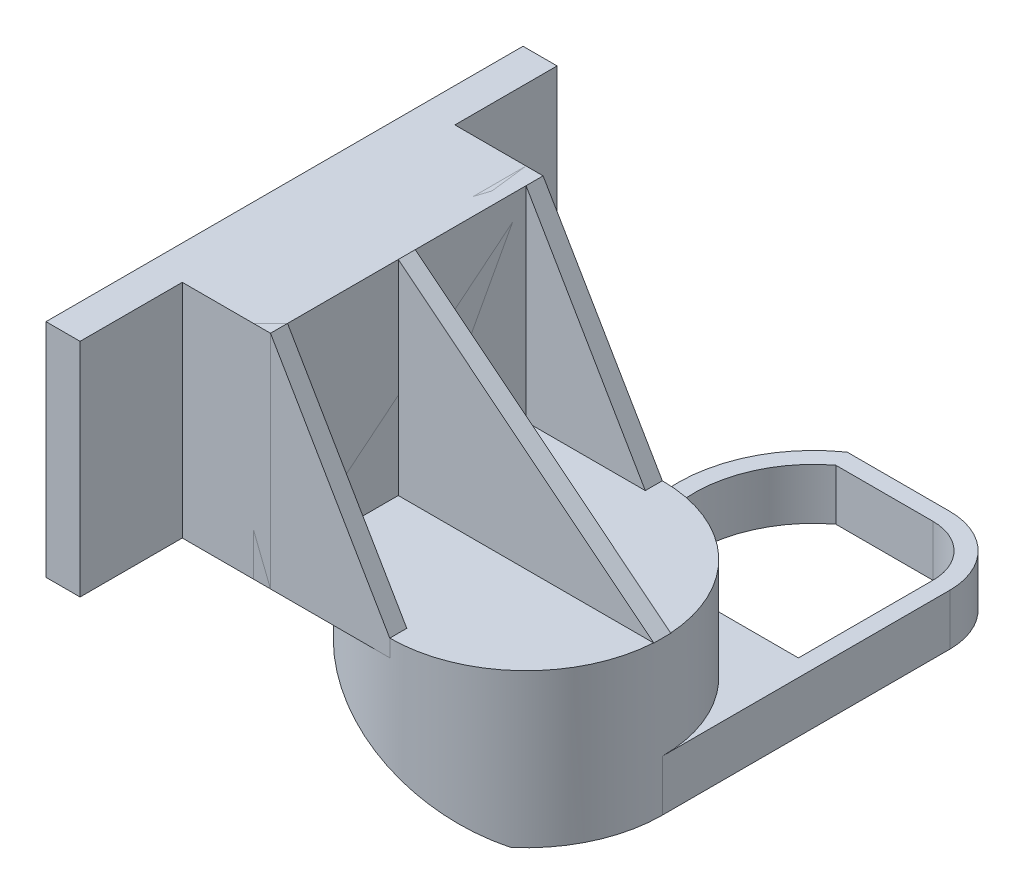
ISO-10303-21;
HEADER;
FILE_DESCRIPTION(('STEP AP214'),'2;1');
FILE_NAME('part.step','',(''),(''),'','','');
FILE_SCHEMA(('AUTOMOTIVE_DESIGN { 1 0 10303 214 1 1 1 1 }'));
ENDSEC;
DATA;
#1=APPLICATION_CONTEXT('core data for automotive mechanical design processes');
#2=APPLICATION_PROTOCOL_DEFINITION('international standard','automotive_design',2000,#1);
#3=PRODUCT_CONTEXT('',#1,'mechanical');
#4=PRODUCT('Part','Part','',(#3));
#5=PRODUCT_RELATED_PRODUCT_CATEGORY('part','',(#4));
#6=PRODUCT_DEFINITION_FORMATION('','',#4);
#7=PRODUCT_DEFINITION_CONTEXT('part definition',#1,'design');
#8=PRODUCT_DEFINITION('design','',#6,#7);
#9=PRODUCT_DEFINITION_SHAPE('','',#8);
#10=(LENGTH_UNIT() NAMED_UNIT(*) SI_UNIT(.MILLI.,.METRE.));
#11=(NAMED_UNIT(*) PLANE_ANGLE_UNIT() SI_UNIT($,.RADIAN.));
#12=(NAMED_UNIT(*) SI_UNIT($,.STERADIAN.) SOLID_ANGLE_UNIT());
#13=UNCERTAINTY_MEASURE_WITH_UNIT(LENGTH_MEASURE(1.E-05),#10,'distance_accuracy_value','');
#14=(GEOMETRIC_REPRESENTATION_CONTEXT(3) GLOBAL_UNCERTAINTY_ASSIGNED_CONTEXT((#13)) GLOBAL_UNIT_ASSIGNED_CONTEXT((#10,
#11,#12)) REPRESENTATION_CONTEXT('',''));
#15=CARTESIAN_POINT('',(0.,0.,0.));
#16=DIRECTION('',(0.,0.,1.));
#17=DIRECTION('',(1.,0.,0.));
#18=AXIS2_PLACEMENT_3D('',#15,#16,#17);
#19=CARTESIAN_POINT('',(-45.0132645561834,2.83837349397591,-44.4499999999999));
#20=DIRECTION('',(-1.,0.,0.));
#21=DIRECTION('',(0.,0.,1.));
#22=AXIS2_PLACEMENT_3D('',#19,#20,#21);
#23=PLANE('',#22);
#24=DIRECTION('',(0.,0.,1.));
#25=VECTOR('',#24,1.);
#26=CARTESIAN_POINT('',(-45.0132645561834,44.1133734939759,-44.4499999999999));
#27=LINE('',#26,#25);
#28=CARTESIAN_POINT('',(-45.0132645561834,44.1133734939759,-44.4499999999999));
#29=VERTEX_POINT('',#28);
#30=CARTESIAN_POINT('',(-45.0132645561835,44.1133734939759,44.4500000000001));
#31=VERTEX_POINT('',#30);
#32=EDGE_CURVE('E144',#29,#31,#27,.T.);
#33=ORIENTED_EDGE('',*,*,#32,.F.);
#34=DIRECTION('',(0.,1.,0.));
#35=VECTOR('',#34,1.);
#36=CARTESIAN_POINT('',(-45.0132645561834,2.83837349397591,-44.4499999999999));
#37=LINE('',#36,#35);
#38=CARTESIAN_POINT('',(-45.0132645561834,2.83837349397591,-44.4499999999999));
#39=VERTEX_POINT('',#38);
#40=EDGE_CURVE('E13',#39,#29,#37,.T.);
#41=ORIENTED_EDGE('',*,*,#40,.F.);
#42=DIRECTION('',(0.,0.,1.));
#43=VECTOR('',#42,1.);
#44=CARTESIAN_POINT('',(-45.0132645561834,2.83837349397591,-44.4499999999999));
#45=LINE('',#44,#43);
#46=CARTESIAN_POINT('',(-45.0132645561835,2.83837349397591,44.4500000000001));
#47=VERTEX_POINT('',#46);
#48=EDGE_CURVE('E164',#39,#47,#45,.T.);
#49=ORIENTED_EDGE('',*,*,#48,.T.);
#50=DIRECTION('',(0.,1.,0.));
#51=VECTOR('',#50,1.);
#52=CARTESIAN_POINT('',(-45.0132645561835,2.83837349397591,44.4500000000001));
#53=LINE('',#52,#51);
#54=EDGE_CURVE('E50',#47,#31,#53,.T.);
#55=ORIENTED_EDGE('',*,*,#54,.T.);
#56=EDGE_LOOP('',(#33,#41,#49,#55));
#57=FACE_BOUND('',#56,.T.);
#58=ADVANCED_FACE('F47',(#57),#23,.T.);
#59=CARTESIAN_POINT('',(-38.6632645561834,2.83837349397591,-44.4499999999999));
#60=DIRECTION('',(0.,0.,-1.));
#61=DIRECTION('',(-1.,0.,0.));
#62=AXIS2_PLACEMENT_3D('',#59,#60,#61);
#63=PLANE('',#62);
#64=DIRECTION('',(-1.,0.,0.));
#65=VECTOR('',#64,1.);
#66=CARTESIAN_POINT('',(-38.6632645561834,44.1133734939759,-44.4499999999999));
#67=LINE('',#66,#65);
#68=CARTESIAN_POINT('',(-38.6632645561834,44.1133734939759,-44.4499999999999));
#69=VERTEX_POINT('',#68);
#70=EDGE_CURVE('E162',#69,#29,#67,.T.);
#71=ORIENTED_EDGE('',*,*,#70,.F.);
#72=DIRECTION('',(0.,1.,0.));
#73=VECTOR('',#72,1.);
#74=CARTESIAN_POINT('',(-38.6632645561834,2.83837349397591,-44.4499999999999));
#75=LINE('',#74,#73);
#76=CARTESIAN_POINT('',(-38.6632645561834,2.83837349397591,-44.4499999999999));
#77=VERTEX_POINT('',#76);
#78=EDGE_CURVE('E56',#77,#69,#75,.T.);
#79=ORIENTED_EDGE('',*,*,#78,.F.);
#80=DIRECTION('',(-1.,0.,0.));
#81=VECTOR('',#80,1.);
#82=CARTESIAN_POINT('',(-38.6632645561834,2.83837349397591,-44.4499999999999));
#83=LINE('',#82,#81);
#84=EDGE_CURVE('E134',#77,#39,#83,.T.);
#85=ORIENTED_EDGE('',*,*,#84,.T.);
#86=ORIENTED_EDGE('',*,*,#40,.T.);
#87=EDGE_LOOP('',(#71,#79,#85,#86));
#88=FACE_BOUND('',#87,.T.);
#89=ADVANCED_FACE('F176',(#88),#63,.T.);
#90=CARTESIAN_POINT('',(-38.6632645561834,2.83837349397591,-44.4499999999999));
#91=DIRECTION('',(1.,0.,0.));
#92=DIRECTION('',(0.,0.,-1.));
#93=AXIS2_PLACEMENT_3D('',#90,#91,#92);
#94=PLANE('',#93);
#95=DIRECTION('',(0.,0.,-1.));
#96=VECTOR('',#95,1.);
#97=CARTESIAN_POINT('',(-38.6632645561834,44.1133734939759,-44.4499999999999));
#98=LINE('',#97,#96);
#99=CARTESIAN_POINT('',(-38.6632645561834,44.1133734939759,-25.4));
#100=VERTEX_POINT('',#99);
#101=EDGE_CURVE('E121',#100,#69,#98,.T.);
#102=ORIENTED_EDGE('',*,*,#101,.F.);
#103=DIRECTION('',(0.,1.,0.));
#104=VECTOR('',#103,1.);
#105=CARTESIAN_POINT('',(-38.6632645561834,2.83837349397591,-25.4));
#106=LINE('',#105,#104);
#107=CARTESIAN_POINT('',(-38.6632645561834,2.83837349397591,-25.4));
#108=VERTEX_POINT('',#107);
#109=EDGE_CURVE('E116',#108,#100,#106,.T.);
#110=ORIENTED_EDGE('',*,*,#109,.F.);
#111=DIRECTION('',(0.,0.,-1.));
#112=VECTOR('',#111,1.);
#113=CARTESIAN_POINT('',(-38.6632645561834,2.83837349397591,-44.4499999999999));
#114=LINE('',#113,#112);
#115=EDGE_CURVE('E119',#108,#77,#114,.T.);
#116=ORIENTED_EDGE('',*,*,#115,.T.);
#117=ORIENTED_EDGE('',*,*,#78,.T.);
#118=EDGE_LOOP('',(#102,#110,#116,#117));
#119=FACE_BOUND('',#118,.T.);
#120=ADVANCED_FACE('F118',(#119),#94,.T.);
#121=CARTESIAN_POINT('',(-22.225,2.83837349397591,-25.4));
#122=DIRECTION('',(0.,0.,-1.));
#123=DIRECTION('',(-1.,0.,0.));
#124=AXIS2_PLACEMENT_3D('',#121,#122,#123);
#125=PLANE('',#124);
#126=DIRECTION('',(-1.,0.,0.));
#127=VECTOR('',#126,1.);
#128=CARTESIAN_POINT('',(-22.225,44.1133734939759,-25.4));
#129=LINE('',#128,#127);
#130=CARTESIAN_POINT('',(-22.225,44.1133734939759,-25.4));
#131=VERTEX_POINT('',#130);
#132=EDGE_CURVE('E159',#131,#100,#129,.T.);
#133=ORIENTED_EDGE('',*,*,#132,.F.);
#134=DIRECTION('',(0.,1.,0.));
#135=VECTOR('',#134,1.);
#136=CARTESIAN_POINT('',(-22.225,2.83837349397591,-25.4));
#137=LINE('',#136,#135);
#138=CARTESIAN_POINT('',(-22.225,2.83837349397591,-25.4));
#139=VERTEX_POINT('',#138);
#140=EDGE_CURVE('E126',#139,#131,#137,.T.);
#141=ORIENTED_EDGE('',*,*,#140,.F.);
#142=DIRECTION('',(-1.,0.,0.));
#143=VECTOR('',#142,1.);
#144=CARTESIAN_POINT('',(-22.225,2.83837349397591,-25.4));
#145=LINE('',#144,#143);
#146=EDGE_CURVE('E132',#139,#108,#145,.T.);
#147=ORIENTED_EDGE('',*,*,#146,.T.);
#148=ORIENTED_EDGE('',*,*,#109,.T.);
#149=EDGE_LOOP('',(#133,#141,#147,#148));
#150=FACE_BOUND('',#149,.T.);
#151=ADVANCED_FACE('F136',(#150),#125,.T.);
#152=CARTESIAN_POINT('',(-22.225,2.83837349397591,25.4));
#153=DIRECTION('',(1.,0.,0.));
#154=DIRECTION('',(0.,0.,-1.));
#155=AXIS2_PLACEMENT_3D('',#152,#153,#154);
#156=PLANE('',#155);
#157=DIRECTION('',(0.,0.,-1.));
#158=VECTOR('',#157,1.);
#159=CARTESIAN_POINT('',(-22.225,44.1133734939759,25.4));
#160=LINE('',#159,#158);
#161=CARTESIAN_POINT('',(-22.225,44.1133734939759,25.4));
#162=VERTEX_POINT('',#161);
#163=EDGE_CURVE('E156',#162,#131,#160,.T.);
#164=ORIENTED_EDGE('',*,*,#163,.F.);
#165=DIRECTION('',(0.,1.,0.));
#166=VECTOR('',#165,1.);
#167=CARTESIAN_POINT('',(-22.225,2.83837349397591,25.4));
#168=LINE('',#167,#166);
#169=CARTESIAN_POINT('',(-22.225,2.83837349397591,25.4));
#170=VERTEX_POINT('',#169);
#171=EDGE_CURVE('E168',#170,#162,#168,.T.);
#172=ORIENTED_EDGE('',*,*,#171,.F.);
#173=DIRECTION('',(0.,0.,-1.));
#174=VECTOR('',#173,1.);
#175=CARTESIAN_POINT('',(-22.225,2.83837349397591,25.4));
#176=LINE('',#175,#174);
#177=EDGE_CURVE('E137',#170,#139,#176,.T.);
#178=ORIENTED_EDGE('',*,*,#177,.T.);
#179=ORIENTED_EDGE('',*,*,#140,.T.);
#180=EDGE_LOOP('',(#164,#172,#178,#179));
#181=FACE_BOUND('',#180,.T.);
#182=ADVANCED_FACE('F189',(#181),#156,.T.);
#183=CARTESIAN_POINT('',(-22.225,2.83837349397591,25.4));
#184=DIRECTION('',(0.,0.,1.));
#185=DIRECTION('',(1.,0.,0.));
#186=AXIS2_PLACEMENT_3D('',#183,#184,#185);
#187=PLANE('',#186);
#188=DIRECTION('',(1.,0.,0.));
#189=VECTOR('',#188,1.);
#190=CARTESIAN_POINT('',(-22.225,44.1133734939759,25.4));
#191=LINE('',#190,#189);
#192=CARTESIAN_POINT('',(-38.6632645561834,44.1133734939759,25.4));
#193=VERTEX_POINT('',#192);
#194=EDGE_CURVE('E153',#193,#162,#191,.T.);
#195=ORIENTED_EDGE('',*,*,#194,.F.);
#196=DIRECTION('',(0.,1.,0.));
#197=VECTOR('',#196,1.);
#198=CARTESIAN_POINT('',(-38.6632645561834,2.83837349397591,25.4));
#199=LINE('',#198,#197);
#200=CARTESIAN_POINT('',(-38.6632645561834,2.83837349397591,25.4));
#201=VERTEX_POINT('',#200);
#202=EDGE_CURVE('E170',#201,#193,#199,.T.);
#203=ORIENTED_EDGE('',*,*,#202,.F.);
#204=DIRECTION('',(1.,0.,0.));
#205=VECTOR('',#204,1.);
#206=CARTESIAN_POINT('',(-22.225,2.83837349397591,25.4));
#207=LINE('',#206,#205);
#208=EDGE_CURVE('E139',#201,#170,#207,.T.);
#209=ORIENTED_EDGE('',*,*,#208,.T.);
#210=ORIENTED_EDGE('',*,*,#171,.T.);
#211=EDGE_LOOP('',(#195,#203,#209,#210));
#212=FACE_BOUND('',#211,.T.);
#213=ADVANCED_FACE('F192',(#212),#187,.T.);
#214=CARTESIAN_POINT('',(-38.6632645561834,2.83837349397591,25.4));
#215=DIRECTION('',(1.,0.,0.));
#216=DIRECTION('',(0.,0.,-1.));
#217=AXIS2_PLACEMENT_3D('',#214,#215,#216);
#218=PLANE('',#217);
#219=DIRECTION('',(0.,0.,-1.));
#220=VECTOR('',#219,1.);
#221=CARTESIAN_POINT('',(-38.6632645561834,44.1133734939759,25.4));
#222=LINE('',#221,#220);
#223=CARTESIAN_POINT('',(-38.6632645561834,44.1133734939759,44.4500000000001));
#224=VERTEX_POINT('',#223);
#225=EDGE_CURVE('E150',#224,#193,#222,.T.);
#226=ORIENTED_EDGE('',*,*,#225,.F.);
#227=DIRECTION('',(0.,1.,0.));
#228=VECTOR('',#227,1.);
#229=CARTESIAN_POINT('',(-38.6632645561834,2.83837349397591,44.4500000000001));
#230=LINE('',#229,#228);
#231=CARTESIAN_POINT('',(-38.6632645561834,2.83837349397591,44.4500000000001));
#232=VERTEX_POINT('',#231);
#233=EDGE_CURVE('E171',#232,#224,#230,.T.);
#234=ORIENTED_EDGE('',*,*,#233,.F.);
#235=DIRECTION('',(0.,0.,-1.));
#236=VECTOR('',#235,1.);
#237=CARTESIAN_POINT('',(-38.6632645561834,2.83837349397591,25.4));
#238=LINE('',#237,#236);
#239=EDGE_CURVE('E267',#232,#201,#238,.T.);
#240=ORIENTED_EDGE('',*,*,#239,.T.);
#241=ORIENTED_EDGE('',*,*,#202,.T.);
#242=EDGE_LOOP('',(#226,#234,#240,#241));
#243=FACE_BOUND('',#242,.T.);
#244=ADVANCED_FACE('F196',(#243),#218,.T.);
#245=CARTESIAN_POINT('',(-38.6632645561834,2.83837349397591,44.4500000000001));
#246=DIRECTION('',(0.,0.,1.));
#247=DIRECTION('',(1.,0.,0.));
#248=AXIS2_PLACEMENT_3D('',#245,#246,#247);
#249=PLANE('',#248);
#250=DIRECTION('',(1.,0.,0.));
#251=VECTOR('',#250,1.);
#252=CARTESIAN_POINT('',(-38.6632645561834,44.1133734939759,44.4500000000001));
#253=LINE('',#252,#251);
#254=EDGE_CURVE('E147',#31,#224,#253,.T.);
#255=ORIENTED_EDGE('',*,*,#254,.F.);
#256=ORIENTED_EDGE('',*,*,#54,.F.);
#257=DIRECTION('',(1.,0.,0.));
#258=VECTOR('',#257,1.);
#259=CARTESIAN_POINT('',(-38.6632645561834,2.83837349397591,44.4500000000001));
#260=LINE('',#259,#258);
#261=EDGE_CURVE('E268',#47,#232,#260,.T.);
#262=ORIENTED_EDGE('',*,*,#261,.T.);
#263=ORIENTED_EDGE('',*,*,#233,.T.);
#264=EDGE_LOOP('',(#255,#256,#262,#263));
#265=FACE_BOUND('',#264,.T.);
#266=ADVANCED_FACE('F173',(#265),#249,.T.);
#267=CARTESIAN_POINT('',(0.,2.83837349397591,0.));
#268=DIRECTION('',(0.,-1.,0.));
#269=DIRECTION('',(0.,0.,-1.));
#270=AXIS2_PLACEMENT_3D('',#267,#268,#269);
#271=PLANE('',#270);
#272=ORIENTED_EDGE('',*,*,#48,.F.);
#273=ORIENTED_EDGE('',*,*,#84,.F.);
#274=ORIENTED_EDGE('',*,*,#115,.F.);
#275=ORIENTED_EDGE('',*,*,#146,.F.);
#276=ORIENTED_EDGE('',*,*,#177,.F.);
#277=ORIENTED_EDGE('',*,*,#208,.F.);
#278=ORIENTED_EDGE('',*,*,#239,.F.);
#279=ORIENTED_EDGE('',*,*,#261,.F.);
#280=EDGE_LOOP('',(#272,#273,#274,#275,#276,#277,#278,#279));
#281=FACE_BOUND('',#280,.T.);
#282=ADVANCED_FACE('F130',(#281),#271,.T.);
#283=CARTESIAN_POINT('',(0.,44.1133734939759,0.));
#284=DIRECTION('',(0.,-1.,0.));
#285=DIRECTION('',(0.,0.,-1.));
#286=AXIS2_PLACEMENT_3D('',#283,#284,#285);
#287=PLANE('',#286);
#288=ORIENTED_EDGE('',*,*,#32,.T.);
#289=ORIENTED_EDGE('',*,*,#254,.T.);
#290=ORIENTED_EDGE('',*,*,#225,.T.);
#291=ORIENTED_EDGE('',*,*,#194,.T.);
#292=ORIENTED_EDGE('',*,*,#163,.T.);
#293=ORIENTED_EDGE('',*,*,#132,.T.);
#294=ORIENTED_EDGE('',*,*,#101,.T.);
#295=ORIENTED_EDGE('',*,*,#70,.T.);
#296=EDGE_LOOP('',(#288,#289,#290,#291,#292,#293,#294,#295));
#297=FACE_BOUND('',#296,.T.);
#298=ADVANCED_FACE('F175',(#297),#287,.F.);
#299=CLOSED_SHELL('',(#58,#89,#120,#151,#182,#213,#244,#266,#282,#298));
#300=MANIFOLD_SOLID_BREP('B2',#299);
#301=CARTESIAN_POINT('',(-22.225,44.1133734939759,25.4));
#302=DIRECTION('',(-1.,0.,0.));
#303=DIRECTION('',(0.,0.,1.));
#304=AXIS2_PLACEMENT_3D('',#301,#302,#303);
#305=PLANE('',#304);
#306=DIRECTION('',(0.,-1.,0.));
#307=VECTOR('',#306,1.);
#308=CARTESIAN_POINT('',(-22.225,44.1133734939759,1.5875));
#309=LINE('',#308,#307);
#310=CARTESIAN_POINT('',(-22.225,44.1133734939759,1.5875));
#311=VERTEX_POINT('',#310);
#312=CARTESIAN_POINT('',(-22.225,6.01337349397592,1.5875));
#313=VERTEX_POINT('',#312);
#314=EDGE_CURVE('E812',#311,#313,#309,.T.);
#315=ORIENTED_EDGE('',*,*,#314,.F.);
#316=DIRECTION('',(0.,0.,-1.));
#317=VECTOR('',#316,1.);
#318=CARTESIAN_POINT('',(-22.225,44.1133734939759,25.4));
#319=LINE('',#318,#317);
#320=CARTESIAN_POINT('',(-22.225,44.1133734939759,22.225));
#321=VERTEX_POINT('',#320);
#322=EDGE_CURVE('E869',#321,#311,#319,.T.);
#323=ORIENTED_EDGE('',*,*,#322,.F.);
#324=DIRECTION('',(0.,-1.,0.));
#325=VECTOR('',#324,1.);
#326=CARTESIAN_POINT('',(-22.225,44.1133734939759,22.225));
#327=LINE('',#326,#325);
#328=CARTESIAN_POINT('',(-22.225,6.01337349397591,22.225));
#329=VERTEX_POINT('',#328);
#330=EDGE_CURVE('E886',#321,#329,#327,.T.);
#331=ORIENTED_EDGE('',*,*,#330,.T.);
#332=DIRECTION('',(0.,0.,-1.));
#333=VECTOR('',#332,1.);
#334=CARTESIAN_POINT('',(-22.225,6.01337349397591,25.4));
#335=LINE('',#334,#333);
#336=EDGE_CURVE('E885',#329,#313,#335,.T.);
#337=ORIENTED_EDGE('',*,*,#336,.T.);
#338=EDGE_LOOP('',(#315,#323,#331,#337));
#339=FACE_BOUND('',#338,.T.);
#340=ADVANCED_FACE('F274',(#339),#305,.F.);
#341=CARTESIAN_POINT('',(0.,6.01337349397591,0.));
#342=DIRECTION('',(0.,1.,0.));
#343=DIRECTION('',(0.,0.,1.));
#344=AXIS2_PLACEMENT_3D('',#341,#342,#343);
#345=PLANE('',#344);
#346=CARTESIAN_POINT('',(0.,6.01337349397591,0.));
#347=DIRECTION('',(0.,1.,0.));
#348=DIRECTION('',(0.,0.,1.));
#349=AXIS2_PLACEMENT_3D('',#346,#347,#348);
#350=CIRCLE('',#349,25.4);
#351=CARTESIAN_POINT('',(0.,6.01337349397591,25.4));
#352=VERTEX_POINT('',#351);
#353=CARTESIAN_POINT('',(25.3503420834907,6.01337349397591,1.5875));
#354=VERTEX_POINT('',#353);
#355=EDGE_CURVE('E905',#352,#354,#350,.T.);
#356=ORIENTED_EDGE('',*,*,#355,.T.);
#357=DIRECTION('',(1.,0.,0.));
#358=VECTOR('',#357,1.);
#359=CARTESIAN_POINT('',(-22.225,6.01337349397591,1.5875));
#360=LINE('',#359,#358);
#361=EDGE_CURVE('E817',#313,#354,#360,.T.);
#362=ORIENTED_EDGE('',*,*,#361,.F.);
#363=ORIENTED_EDGE('',*,*,#336,.F.);
#364=DIRECTION('',(1.,0.,0.));
#365=VECTOR('',#364,1.);
#366=CARTESIAN_POINT('',(-22.225,6.01337349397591,22.225));
#367=LINE('',#366,#365);
#368=CARTESIAN_POINT('',(0.,6.01337349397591,22.225));
#369=VERTEX_POINT('',#368);
#370=EDGE_CURVE('E1083',#329,#369,#367,.T.);
#371=ORIENTED_EDGE('',*,*,#370,.T.);
#372=DIRECTION('',(0.,0.,1.));
#373=VECTOR('',#372,1.);
#374=CARTESIAN_POINT('',(0.,6.01337349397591,22.225));
#375=LINE('',#374,#373);
#376=EDGE_CURVE('E894',#369,#352,#375,.T.);
#377=ORIENTED_EDGE('',*,*,#376,.T.);
#378=EDGE_LOOP('',(#356,#362,#363,#371,#377));
#379=FACE_BOUND('',#378,.T.);
#380=ADVANCED_FACE('F1011',(#379),#345,.T.);
#381=CARTESIAN_POINT('',(-22.225,44.1133734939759,-1.5875));
#382=VERTEX_POINT('',#381);
#383=CARTESIAN_POINT('',(-22.225,44.1133734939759,-22.225));
#384=VERTEX_POINT('',#383);
#385=EDGE_CURVE('E865',#382,#384,#319,.T.);
#386=ORIENTED_EDGE('',*,*,#385,.F.);
#387=DIRECTION('',(0.,-1.,0.));
#388=VECTOR('',#387,1.);
#389=CARTESIAN_POINT('',(-22.225,44.1133734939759,-1.5875));
#390=LINE('',#389,#388);
#391=CARTESIAN_POINT('',(-22.225,6.01337349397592,-1.5875));
#392=VERTEX_POINT('',#391);
#393=EDGE_CURVE('E820',#382,#392,#390,.T.);
#394=ORIENTED_EDGE('',*,*,#393,.T.);
#395=CARTESIAN_POINT('',(-22.225,6.01337349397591,-22.225));
#396=VERTEX_POINT('',#395);
#397=EDGE_CURVE('E890',#392,#396,#335,.T.);
#398=ORIENTED_EDGE('',*,*,#397,.T.);
#399=DIRECTION('',(0.,1.,0.));
#400=VECTOR('',#399,1.);
#401=CARTESIAN_POINT('',(-22.225,44.1133734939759,-22.225));
#402=LINE('',#401,#400);
#403=EDGE_CURVE('E1029',#396,#384,#402,.T.);
#404=ORIENTED_EDGE('',*,*,#403,.T.);
#405=EDGE_LOOP('',(#386,#394,#398,#404));
#406=FACE_BOUND('',#405,.T.);
#407=ADVANCED_FACE('F1013',(#406),#305,.F.);
#408=CARTESIAN_POINT('',(0.,41.9157911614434,0.));
#409=DIRECTION('',(0.,1.,0.));
#410=DIRECTION('',(0.,0.,1.));
#411=AXIS2_PLACEMENT_3D('',#408,#409,#410);
#412=CYLINDRICAL_SURFACE('',#411,22.225);
#413=CARTESIAN_POINT('',(0.,-15.0570810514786,0.));
#414=DIRECTION('',(0.413802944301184,0.910366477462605,0.));
#415=DIRECTION('',(-0.910366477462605,0.413802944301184,0.));
#416=AXIS2_PLACEMENT_3D('',#413,#414,#415);
#417=ELLIPSE('',#416,24.4132451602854,22.225);
#418=CARTESIAN_POINT('',(-3.07628540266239,-13.6587695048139,-22.0110675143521));
#419=VERTEX_POINT('',#418);
#420=CARTESIAN_POINT('',(16.51,-22.5616265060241,14.8785256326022));
#421=VERTEX_POINT('',#420);
#422=EDGE_CURVE('E810',#419,#421,#417,.T.);
#423=ORIENTED_EDGE('',*,*,#422,.F.);
#424=DIRECTION('',(0.,-1.,0.));
#425=VECTOR('',#424,1.);
#426=CARTESIAN_POINT('',(-3.07628540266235,-13.0366265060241,-22.0110675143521));
#427=LINE('',#426,#425);
#428=CARTESIAN_POINT('',(-3.07628540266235,-22.5616265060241,-22.0110675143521));
#429=VERTEX_POINT('',#428);
#430=EDGE_CURVE('E738',#419,#429,#427,.T.);
#431=ORIENTED_EDGE('',*,*,#430,.T.);
#432=CARTESIAN_POINT('',(0.,-22.5616265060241,0.));
#433=DIRECTION('',(0.,1.,0.));
#434=DIRECTION('',(0.,0.,1.));
#435=AXIS2_PLACEMENT_3D('',#432,#433,#434);
#436=CIRCLE('',#435,22.225);
#437=EDGE_CURVE('E926',#421,#429,#436,.T.);
#438=ORIENTED_EDGE('',*,*,#437,.F.);
#439=EDGE_LOOP('',(#423,#431,#438));
#440=FACE_BOUND('',#439,.T.);
#441=CARTESIAN_POINT('',(0.,2.83837349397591,0.));
#442=DIRECTION('',(0.,1.,0.));
#443=DIRECTION('',(0.,0.,1.));
#444=AXIS2_PLACEMENT_3D('',#441,#442,#443);
#445=CIRCLE('',#444,22.225);
#446=CARTESIAN_POINT('',(0.,2.83837349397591,22.225));
#447=VERTEX_POINT('',#446);
#448=EDGE_CURVE('E1038',#447,#447,#445,.T.);
#449=ORIENTED_EDGE('',*,*,#448,.T.);
#450=EDGE_LOOP('',(#449));
#451=FACE_BOUND('',#450,.T.);
#452=ADVANCED_FACE('F276',(#440,#451),#412,.F.);
#453=CARTESIAN_POINT('',(-22.225,-22.5616265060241,0.));
#454=DIRECTION('',(0.,-1.,0.));
#455=DIRECTION('',(0.,0.,-1.));
#456=AXIS2_PLACEMENT_3D('',#453,#454,#455);
#457=PLANE('',#456);
#458=CARTESIAN_POINT('',(-15.5893894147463,-22.5616265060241,-59.0528167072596));
#459=DIRECTION('',(0.,-1.,0.));
#460=DIRECTION('',(0.,0.,-1.));
#461=AXIS2_PLACEMENT_3D('',#458,#459,#460);
#462=CIRCLE('',#461,0.952500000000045);
#463=CARTESIAN_POINT('',(-14.763229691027,-22.5616265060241,-58.5787741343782));
#464=VERTEX_POINT('',#463);
#465=CARTESIAN_POINT('',(-16.4155491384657,-22.5616265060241,-59.5268592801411));
#466=VERTEX_POINT('',#465);
#467=EDGE_CURVE('E289',#464,#466,#462,.T.);
#468=ORIENTED_EDGE('',*,*,#467,.F.);
#469=CARTESIAN_POINT('',(8.09385599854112,-22.5616265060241,-45.4635962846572));
#470=DIRECTION('',(0.,1.,0.));
#471=DIRECTION('',(0.,0.,-1.));
#472=AXIS2_PLACEMENT_3D('',#469,#470,#471);
#473=CIRCLE('',#472,26.3525000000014);
#474=CARTESIAN_POINT('',(-12.335420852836,-22.5616265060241,-62.1098842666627));
#475=VERTEX_POINT('',#474);
#476=EDGE_CURVE('E617',#475,#464,#473,.T.);
#477=ORIENTED_EDGE('',*,*,#476,.F.);
#478=CARTESIAN_POINT('',(-13.0738284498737,-22.5616265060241,-62.7115573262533));
#479=DIRECTION('',(0.,-1.,0.));
#480=DIRECTION('',(0.,0.,-1.));
#481=AXIS2_PLACEMENT_3D('',#478,#479,#480);
#482=CIRCLE('',#481,0.952500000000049);
#483=CARTESIAN_POINT('',(-13.8122360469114,-22.5616265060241,-63.3132303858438));
#484=VERTEX_POINT('',#483);
#485=EDGE_CURVE('E600',#484,#475,#482,.T.);
#486=ORIENTED_EDGE('',*,*,#485,.F.);
#487=CARTESIAN_POINT('',(8.09385599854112,-22.5616265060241,-45.4635962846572));
#488=DIRECTION('',(0.,-1.,0.));
#489=DIRECTION('',(0.,0.,-1.));
#490=AXIS2_PLACEMENT_3D('',#487,#488,#489);
#491=CIRCLE('',#490,28.2575000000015);
#492=EDGE_CURVE('E610',#466,#484,#491,.T.);
#493=ORIENTED_EDGE('',*,*,#492,.F.);
#494=EDGE_LOOP('',(#468,#477,#486,#493));
#495=FACE_BOUND('',#494,.T.);
#496=CARTESIAN_POINT('',(-18.6295489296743,-22.5616265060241,-51.069187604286));
#497=DIRECTION('',(0.,-1.,0.));
#498=DIRECTION('',(0.,0.,-1.));
#499=AXIS2_PLACEMENT_3D('',#496,#497,#498);
#500=CIRCLE('',#499,0.952500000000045);
#501=CARTESIAN_POINT('',(-17.6973371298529,-22.5616265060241,-50.8736437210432));
#502=VERTEX_POINT('',#501);
#503=CARTESIAN_POINT('',(-19.5617607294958,-22.5616265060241,-51.2647314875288));
#504=VERTEX_POINT('',#503);
#505=EDGE_CURVE('E297',#502,#504,#500,.T.);
#506=ORIENTED_EDGE('',*,*,#505,.F.);
#507=CARTESIAN_POINT('',(8.09385599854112,-22.5616265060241,-45.4635962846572));
#508=DIRECTION('',(0.,1.,0.));
#509=DIRECTION('',(0.,0.,-1.));
#510=AXIS2_PLACEMENT_3D('',#507,#508,#509);
#511=CIRCLE('',#510,26.3525000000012);
#512=CARTESIAN_POINT('',(-16.4795267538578,-22.5616265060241,-54.9821632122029));
#513=VERTEX_POINT('',#512);
#514=EDGE_CURVE('E635',#513,#502,#511,.T.);
#515=ORIENTED_EDGE('',*,*,#514,.F.);
#516=CARTESIAN_POINT('',(-17.3677213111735,-22.5616265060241,-55.3262077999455));
#517=DIRECTION('',(0.,-1.,0.));
#518=DIRECTION('',(0.,0.,-1.));
#519=AXIS2_PLACEMENT_3D('',#516,#517,#518);
#520=CIRCLE('',#519,0.952500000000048);
#521=CARTESIAN_POINT('',(-18.2559158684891,-22.5616265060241,-55.6702523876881));
#522=VERTEX_POINT('',#521);
#523=EDGE_CURVE('E632',#522,#513,#520,.T.);
#524=ORIENTED_EDGE('',*,*,#523,.F.);
#525=CARTESIAN_POINT('',(8.09385599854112,-22.5616265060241,-45.4635962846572));
#526=DIRECTION('',(0.,-1.,0.));
#527=DIRECTION('',(0.,0.,-1.));
#528=AXIS2_PLACEMENT_3D('',#525,#526,#527);
#529=CIRCLE('',#528,28.2575000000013);
#530=EDGE_CURVE('E628',#504,#522,#529,.T.);
#531=ORIENTED_EDGE('',*,*,#530,.F.);
#532=EDGE_LOOP('',(#506,#515,#524,#531));
#533=FACE_BOUND('',#532,.T.);
#534=CARTESIAN_POINT('',(-19.053835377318,-22.5616265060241,-42.5368441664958));
#535=DIRECTION('',(0.,-1.,0.));
#536=DIRECTION('',(0.,0.,-1.));
#537=AXIS2_PLACEMENT_3D('',#534,#535,#536);
#538=CIRCLE('',#537,0.952500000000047);
#539=CARTESIAN_POINT('',(-18.1068228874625,-22.5616265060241,-42.6389401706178));
#540=VERTEX_POINT('',#539);
#541=CARTESIAN_POINT('',(-20.0008478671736,-22.5616265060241,-42.4347481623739));
#542=VERTEX_POINT('',#541);
#543=EDGE_CURVE('E646',#540,#542,#538,.T.);
#544=ORIENTED_EDGE('',*,*,#543,.F.);
#545=CARTESIAN_POINT('',(8.09385599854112,-22.5616265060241,-45.4635962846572));
#546=DIRECTION('',(0.,1.,0.));
#547=DIRECTION('',(0.,0.,-1.));
#548=AXIS2_PLACEMENT_3D('',#545,#546,#547);
#549=CIRCLE('',#548,26.3525000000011);
#550=CARTESIAN_POINT('',(-18.2182187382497,-22.5616265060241,-46.9226985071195));
#551=VERTEX_POINT('',#550);
#552=EDGE_CURVE('E655',#551,#540,#549,.T.);
#553=ORIENTED_EDGE('',*,*,#552,.F.);
#554=CARTESIAN_POINT('',(-19.1692575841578,-22.5616265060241,-46.9754371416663));
#555=DIRECTION('',(0.,-1.,0.));
#556=DIRECTION('',(0.,0.,-1.));
#557=AXIS2_PLACEMENT_3D('',#554,#555,#556);
#558=CIRCLE('',#557,0.952500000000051);
#559=CARTESIAN_POINT('',(-20.1202964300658,-22.5616265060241,-47.0281757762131));
#560=VERTEX_POINT('',#559);
#561=EDGE_CURVE('E652',#560,#551,#558,.T.);
#562=ORIENTED_EDGE('',*,*,#561,.F.);
#563=CARTESIAN_POINT('',(8.09385599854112,-22.5616265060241,-45.4635962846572));
#564=DIRECTION('',(0.,-1.,0.));
#565=DIRECTION('',(0.,0.,-1.));
#566=AXIS2_PLACEMENT_3D('',#563,#564,#565);
#567=CIRCLE('',#566,28.2575000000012);
#568=EDGE_CURVE('E648',#542,#560,#567,.T.);
#569=ORIENTED_EDGE('',*,*,#568,.F.);
#570=EDGE_LOOP('',(#544,#553,#562,#569));
#571=FACE_BOUND('',#570,.T.);
#572=CARTESIAN_POINT('',(-16.8207166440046,-22.5616265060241,-34.2909916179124));
#573=DIRECTION('',(0.,-1.,0.));
#574=DIRECTION('',(0.,0.,-1.));
#575=AXIS2_PLACEMENT_3D('',#572,#573,#574);
#576=CIRCLE('',#575,0.952500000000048);
#577=CARTESIAN_POINT('',(-15.951603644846,-22.5616265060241,-34.680733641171));
#578=VERTEX_POINT('',#577);
#579=CARTESIAN_POINT('',(-17.6898296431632,-22.5616265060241,-33.9012495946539));
#580=VERTEX_POINT('',#579);
#581=EDGE_CURVE('E666',#578,#580,#576,.T.);
#582=ORIENTED_EDGE('',*,*,#581,.F.);
#583=CARTESIAN_POINT('',(8.09385599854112,-22.5616265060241,-45.4635962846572));
#584=DIRECTION('',(0.,1.,0.));
#585=DIRECTION('',(0.,0.,-1.));
#586=AXIS2_PLACEMENT_3D('',#583,#584,#585);
#587=CIRCLE('',#586,26.3525000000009);
#588=CARTESIAN_POINT('',(-17.3813015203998,-22.5616265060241,-38.7204067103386));
#589=VERTEX_POINT('',#588);
#590=EDGE_CURVE('E675',#589,#578,#587,.T.);
#591=ORIENTED_EDGE('',*,*,#590,.F.);
#592=CARTESIAN_POINT('',(-18.3020903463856,-22.5616265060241,-38.4766769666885));
#593=DIRECTION('',(0.,-1.,0.));
#594=DIRECTION('',(0.,0.,-1.));
#595=AXIS2_PLACEMENT_3D('',#592,#593,#594);
#596=CIRCLE('',#595,0.952500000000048);
#597=CARTESIAN_POINT('',(-19.2228791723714,-22.5616265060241,-38.2329472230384));
#598=VERTEX_POINT('',#597);
#599=EDGE_CURVE('E672',#598,#589,#596,.T.);
#600=ORIENTED_EDGE('',*,*,#599,.F.);
#601=CARTESIAN_POINT('',(8.09385599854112,-22.5616265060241,-45.4635962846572));
#602=DIRECTION('',(0.,-1.,0.));
#603=DIRECTION('',(0.,0.,-1.));
#604=AXIS2_PLACEMENT_3D('',#601,#602,#603);
#605=CIRCLE('',#604,28.257500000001);
#606=EDGE_CURVE('E668',#580,#598,#605,.T.);
#607=ORIENTED_EDGE('',*,*,#606,.F.);
#608=EDGE_LOOP('',(#582,#591,#600,#607));
#609=FACE_BOUND('',#608,.T.);
#610=CARTESIAN_POINT('',(-12.1487859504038,-22.5616265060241,-27.1387914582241));
#611=DIRECTION('',(0.,-1.,0.));
#612=DIRECTION('',(0.,0.,-1.));
#613=AXIS2_PLACEMENT_3D('',#610,#611,#612);
#614=CIRCLE('',#613,0.952500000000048);
#615=CARTESIAN_POINT('',(-11.4426472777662,-22.5616265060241,-27.7780288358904));
#616=VERTEX_POINT('',#615);
#617=CARTESIAN_POINT('',(-12.8549246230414,-22.5616265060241,-26.4995540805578));
#618=VERTEX_POINT('',#617);
#619=EDGE_CURVE('E686',#616,#618,#614,.T.);
#620=ORIENTED_EDGE('',*,*,#619,.F.);
#621=CARTESIAN_POINT('',(8.09385599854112,-22.5616265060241,-45.4635962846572));
#622=DIRECTION('',(0.,1.,0.));
#623=DIRECTION('',(0.,0.,-1.));
#624=AXIS2_PLACEMENT_3D('',#621,#622,#623);
#625=CIRCLE('',#624,26.3525000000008);
#626=CARTESIAN_POINT('',(-14.0506983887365,-22.5616265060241,-31.1781852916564));
#627=VERTEX_POINT('',#626);
#628=EDGE_CURVE('E694',#627,#616,#625,.T.);
#629=ORIENTED_EDGE('',*,*,#628,.F.);
#630=CARTESIAN_POINT('',(-14.8511039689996,-22.5616265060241,-30.6618451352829));
#631=DIRECTION('',(0.,-1.,0.));
#632=DIRECTION('',(0.,0.,-1.));
#633=AXIS2_PLACEMENT_3D('',#630,#631,#632);
#634=CIRCLE('',#633,0.952500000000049);
#635=CARTESIAN_POINT('',(-15.6515095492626,-22.5616265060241,-30.1455049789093));
#636=VERTEX_POINT('',#635);
#637=EDGE_CURVE('E691',#636,#627,#634,.T.);
#638=ORIENTED_EDGE('',*,*,#637,.F.);
#639=CARTESIAN_POINT('',(8.09385599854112,-22.5616265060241,-45.4635962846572));
#640=DIRECTION('',(0.,-1.,0.));
#641=DIRECTION('',(0.,0.,-1.));
#642=AXIS2_PLACEMENT_3D('',#639,#640,#641);
#643=CIRCLE('',#642,28.2575000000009);
#644=EDGE_CURVE('E688',#618,#636,#643,.T.);
#645=ORIENTED_EDGE('',*,*,#644,.F.);
#646=EDGE_LOOP('',(#620,#629,#638,#645));
#647=FACE_BOUND('',#646,.T.);
#648=DIRECTION('',(-1.,0.,0.));
#649=VECTOR('',#648,1.);
#650=CARTESIAN_POINT('',(22.225,-22.5616265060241,-28.5356029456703));
#651=LINE('',#650,#649);
#652=CARTESIAN_POINT('',(22.225,-22.5616265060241,-28.5356029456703));
#653=VERTEX_POINT('',#652);
#654=CARTESIAN_POINT('',(-6.30731293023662,-22.5616265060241,-28.5356029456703));
#655=VERTEX_POINT('',#654);
#656=EDGE_CURVE('E716',#653,#655,#651,.T.);
#657=ORIENTED_EDGE('',*,*,#656,.F.);
#658=DIRECTION('',(0.,0.,1.));
#659=VECTOR('',#658,1.);
#660=CARTESIAN_POINT('',(22.225,-22.5616265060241,-53.60017409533));
#661=LINE('',#660,#659);
#662=CARTESIAN_POINT('',(22.225,-22.5616265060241,-53.60017409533));
#663=VERTEX_POINT('',#662);
#664=EDGE_CURVE('E713',#663,#653,#661,.T.);
#665=ORIENTED_EDGE('',*,*,#664,.F.);
#666=CARTESIAN_POINT('',(12.7,-22.5616265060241,-53.60017409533));
#667=DIRECTION('',(0.,-1.,0.));
#668=DIRECTION('',(0.,0.,-1.));
#669=AXIS2_PLACEMENT_3D('',#666,#667,#668);
#670=CIRCLE('',#669,9.525);
#671=CARTESIAN_POINT('',(12.7,-22.5616265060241,-63.12517409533));
#672=VERTEX_POINT('',#671);
#673=EDGE_CURVE('E710',#672,#663,#670,.T.);
#674=ORIENTED_EDGE('',*,*,#673,.F.);
#675=DIRECTION('',(1.,0.,0.));
#676=VECTOR('',#675,1.);
#677=CARTESIAN_POINT('',(-5.39759663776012,-22.5616265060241,-63.12517409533));
#678=LINE('',#677,#676);
#679=CARTESIAN_POINT('',(-5.39759663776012,-22.5616265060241,-63.12517409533));
#680=VERTEX_POINT('',#679);
#681=EDGE_CURVE('E707',#680,#672,#678,.T.);
#682=ORIENTED_EDGE('',*,*,#681,.F.);
#683=CARTESIAN_POINT('',(8.09385599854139,-22.5616265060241,-45.4635962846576));
#684=DIRECTION('',(0.,-1.,0.));
#685=DIRECTION('',(0.,0.,-1.));
#686=AXIS2_PLACEMENT_3D('',#683,#684,#685);
#687=CIRCLE('',#686,22.225);
#688=EDGE_CURVE('E624',#655,#680,#687,.T.);
#689=ORIENTED_EDGE('',*,*,#688,.F.);
#690=EDGE_LOOP('',(#657,#665,#674,#682,#689));
#691=FACE_BOUND('',#690,.T.);
#692=DIRECTION('',(-0.990545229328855,0.,-0.137186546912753));
#693=VECTOR('',#692,1.);
#694=CARTESIAN_POINT('',(-10.6490628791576,-22.5616265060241,-23.0598668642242));
#695=LINE('',#694,#693);
#696=CARTESIAN_POINT('',(-10.6490628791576,-22.5616265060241,-23.0598668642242));
#697=VERTEX_POINT('',#696);
#698=EDGE_CURVE('E722',#429,#697,#695,.T.);
#699=ORIENTED_EDGE('',*,*,#698,.T.);
#700=CARTESIAN_POINT('',(8.09385599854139,-22.5616265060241,-45.4635962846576));
#701=DIRECTION('',(0.,-1.,0.));
#702=DIRECTION('',(0.,0.,1.));
#703=AXIS2_PLACEMENT_3D('',#700,#701,#702);
#704=CIRCLE('',#703,29.21);
#705=CARTESIAN_POINT('',(-13.42901173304,-22.5616265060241,-65.2117674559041));
#706=VERTEX_POINT('',#705);
#707=EDGE_CURVE('E755',#697,#706,#704,.T.);
#708=ORIENTED_EDGE('',*,*,#707,.T.);
#709=DIRECTION('',(0.994040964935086,0.,0.10900715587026));
#710=VECTOR('',#709,1.);
#711=CARTESIAN_POINT('',(-13.42901173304,-22.5616265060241,-65.2117674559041));
#712=LINE('',#711,#710);
#713=CARTESIAN_POINT('',(-8.52324779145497,-22.5616265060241,-64.6737983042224));
#714=VERTEX_POINT('',#713);
#715=EDGE_CURVE('E760',#706,#714,#712,.T.);
#716=ORIENTED_EDGE('',*,*,#715,.T.);
#717=CARTESIAN_POINT('',(8.09385599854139,-22.5616265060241,-45.4635962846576));
#718=DIRECTION('',(0.,-1.,0.));
#719=DIRECTION('',(0.,0.,-1.));
#720=AXIS2_PLACEMENT_3D('',#717,#718,#719);
#721=CIRCLE('',#720,25.4);
#722=CARTESIAN_POINT('',(-6.43188064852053,-22.5616265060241,-66.30017409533));
#723=VERTEX_POINT('',#722);
#724=EDGE_CURVE('E771',#723,#714,#721,.F.);
#725=ORIENTED_EDGE('',*,*,#724,.F.);
#726=DIRECTION('',(-1.,0.,0.));
#727=VECTOR('',#726,1.);
#728=CARTESIAN_POINT('',(0.,-22.5616265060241,-66.30017409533));
#729=LINE('',#728,#727);
#730=CARTESIAN_POINT('',(12.7,-22.5616265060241,-66.30017409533));
#731=VERTEX_POINT('',#730);
#732=EDGE_CURVE('E791',#731,#723,#729,.T.);
#733=ORIENTED_EDGE('',*,*,#732,.F.);
#734=CARTESIAN_POINT('',(12.7,-22.5616265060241,-53.60017409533));
#735=DIRECTION('',(0.,-1.,0.));
#736=DIRECTION('',(0.,0.,-1.));
#737=AXIS2_PLACEMENT_3D('',#734,#735,#736);
#738=CIRCLE('',#737,12.7);
#739=CARTESIAN_POINT('',(25.4,-22.5616265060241,-53.60017409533));
#740=VERTEX_POINT('',#739);
#741=EDGE_CURVE('E793',#731,#740,#738,.T.);
#742=ORIENTED_EDGE('',*,*,#741,.T.);
#743=DIRECTION('',(0.,0.,-1.));
#744=VECTOR('',#743,1.);
#745=CARTESIAN_POINT('',(25.4,-22.5616265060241,0.));
#746=LINE('',#745,#744);
#747=CARTESIAN_POINT('',(25.4,-22.5616265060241,0.));
#748=VERTEX_POINT('',#747);
#749=EDGE_CURVE('E779',#748,#740,#746,.T.);
#750=ORIENTED_EDGE('',*,*,#749,.F.);
#751=CARTESIAN_POINT('',(0.,-22.5616265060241,0.));
#752=DIRECTION('',(0.,1.,0.));
#753=DIRECTION('',(0.,0.,1.));
#754=AXIS2_PLACEMENT_3D('',#751,#752,#753);
#755=CIRCLE('',#754,25.4);
#756=CARTESIAN_POINT('',(16.51,-22.5616265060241,19.3023288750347));
#757=VERTEX_POINT('',#756);
#758=EDGE_CURVE('E1044',#757,#748,#755,.T.);
#759=ORIENTED_EDGE('',*,*,#758,.F.);
#760=DIRECTION('',(0.,0.,1.));
#761=VECTOR('',#760,1.);
#762=CARTESIAN_POINT('',(16.51,-22.5616265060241,-25.4));
#763=LINE('',#762,#761);
#764=EDGE_CURVE('E801',#421,#757,#763,.T.);
#765=ORIENTED_EDGE('',*,*,#764,.F.);
#766=ORIENTED_EDGE('',*,*,#437,.T.);
#767=EDGE_LOOP('',(#699,#708,#716,#725,#733,#742,#750,#759,#765,#766));
#768=FACE_BOUND('',#767,.T.);
#769=ADVANCED_FACE('F614',(#495,#533,#571,#609,#647,#691,#768),#457,.T.);
#770=CARTESIAN_POINT('',(0.,41.9157911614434,0.));
#771=DIRECTION('',(0.,1.,0.));
#772=DIRECTION('',(0.,0.,1.));
#773=AXIS2_PLACEMENT_3D('',#770,#771,#772);
#774=CYLINDRICAL_SURFACE('',#773,25.4);
#775=DIRECTION('',(0.,-1.,0.));
#776=VECTOR('',#775,1.);
#777=CARTESIAN_POINT('',(25.4,-13.0366265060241,0.));
#778=LINE('',#777,#776);
#779=CARTESIAN_POINT('',(25.4,-13.0366265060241,0.));
#780=VERTEX_POINT('',#779);
#781=EDGE_CURVE('E798',#780,#748,#778,.T.);
#782=ORIENTED_EDGE('',*,*,#781,.F.);
#783=CARTESIAN_POINT('',(0.,-13.0366265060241,0.));
#784=DIRECTION('',(0.,-1.,0.));
#785=DIRECTION('',(0.,0.,-1.));
#786=AXIS2_PLACEMENT_3D('',#783,#784,#785);
#787=CIRCLE('',#786,25.4);
#788=CARTESIAN_POINT('',(-4.44499999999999,-13.0366265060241,-25.0080382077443));
#789=VERTEX_POINT('',#788);
#790=EDGE_CURVE('E776',#789,#780,#787,.T.);
#791=ORIENTED_EDGE('',*,*,#790,.F.);
#792=CARTESIAN_POINT('',(0.,-15.0570810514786,0.));
#793=DIRECTION('',(0.413802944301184,0.910366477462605,0.));
#794=DIRECTION('',(-0.910366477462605,0.413802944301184,0.));
#795=AXIS2_PLACEMENT_3D('',#792,#793,#794);
#796=ELLIPSE('',#795,27.9008516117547,25.4);
#797=EDGE_CURVE('E922',#757,#789,#796,.F.);
#798=ORIENTED_EDGE('',*,*,#797,.F.);
#799=ORIENTED_EDGE('',*,*,#758,.T.);
#800=EDGE_LOOP('',(#782,#791,#798,#799));
#801=FACE_BOUND('',#800,.T.);
#802=CARTESIAN_POINT('',(0.,2.83837349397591,0.));
#803=DIRECTION('',(0.,1.,0.));
#804=DIRECTION('',(0.,0.,1.));
#805=AXIS2_PLACEMENT_3D('',#802,#803,#804);
#806=CIRCLE('',#805,25.4);
#807=CARTESIAN_POINT('',(0.,2.83837349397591,-25.4));
#808=VERTEX_POINT('',#807);
#809=CARTESIAN_POINT('',(-25.4,2.83837349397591,0.));
#810=VERTEX_POINT('',#809);
#811=EDGE_CURVE('E1047',#808,#810,#806,.T.);
#812=ORIENTED_EDGE('',*,*,#811,.F.);
#813=DIRECTION('',(0.,-1.,0.));
#814=VECTOR('',#813,1.);
#815=CARTESIAN_POINT('',(0.,6.01337349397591,-25.4));
#816=LINE('',#815,#814);
#817=CARTESIAN_POINT('',(0.,6.01337349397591,-25.4));
#818=VERTEX_POINT('',#817);
#819=EDGE_CURVE('E1042',#818,#808,#816,.T.);
#820=ORIENTED_EDGE('',*,*,#819,.F.);
#821=CARTESIAN_POINT('',(25.3503420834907,6.01337349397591,-1.5875));
#822=VERTEX_POINT('',#821);
#823=EDGE_CURVE('E919',#822,#818,#350,.T.);
#824=ORIENTED_EDGE('',*,*,#823,.F.);
#825=CARTESIAN_POINT('',(25.4,6.01337349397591,0.));
#826=VERTEX_POINT('',#825);
#827=EDGE_CURVE('E916',#826,#822,#350,.T.);
#828=ORIENTED_EDGE('',*,*,#827,.F.);
#829=EDGE_CURVE('E911',#354,#826,#350,.T.);
#830=ORIENTED_EDGE('',*,*,#829,.F.);
#831=ORIENTED_EDGE('',*,*,#355,.F.);
#832=DIRECTION('',(0.,-1.,0.));
#833=VECTOR('',#832,1.);
#834=CARTESIAN_POINT('',(0.,6.01337349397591,25.4));
#835=LINE('',#834,#833);
#836=CARTESIAN_POINT('',(0.,2.83837349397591,25.4));
#837=VERTEX_POINT('',#836);
#838=EDGE_CURVE('E910',#352,#837,#835,.T.);
#839=ORIENTED_EDGE('',*,*,#838,.T.);
#840=EDGE_CURVE('E1041',#810,#837,#806,.T.);
#841=ORIENTED_EDGE('',*,*,#840,.F.);
#842=EDGE_LOOP('',(#812,#820,#824,#828,#830,#831,#839,#841));
#843=FACE_BOUND('',#842,.T.);
#844=ADVANCED_FACE('F1113',(#801,#843),#774,.T.);
#845=CARTESIAN_POINT('',(0.,2.83837349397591,0.));
#846=DIRECTION('',(0.,1.,0.));
#847=DIRECTION('',(0.,0.,1.));
#848=AXIS2_PLACEMENT_3D('',#845,#846,#847);
#849=PLANE('',#848);
#850=ORIENTED_EDGE('',*,*,#448,.F.);
#851=EDGE_LOOP('',(#850));
#852=FACE_BOUND('',#851,.T.);
#853=ADVANCED_FACE('F1120',(#852),#849,.F.);
#854=DIRECTION('',(-1.,0.,0.));
#855=VECTOR('',#854,1.);
#856=CARTESIAN_POINT('',(0.,2.83837349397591,-25.4));
#857=LINE('',#856,#855);
#858=CARTESIAN_POINT('',(-25.4,2.83837349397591,-25.4));
#859=VERTEX_POINT('',#858);
#860=EDGE_CURVE('E912',#808,#859,#857,.T.);
#861=ORIENTED_EDGE('',*,*,#860,.F.);
#862=ORIENTED_EDGE('',*,*,#811,.T.);
#863=DIRECTION('',(0.,0.,1.));
#864=VECTOR('',#863,1.);
#865=CARTESIAN_POINT('',(-25.4,2.83837349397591,0.));
#866=LINE('',#865,#864);
#867=EDGE_CURVE('E1060',#859,#810,#866,.T.);
#868=ORIENTED_EDGE('',*,*,#867,.F.);
#869=EDGE_LOOP('',(#861,#862,#868));
#870=FACE_BOUND('',#869,.T.);
#871=ADVANCED_FACE('F1117',(#870),#849,.F.);
#872=CARTESIAN_POINT('',(-25.4,2.83837349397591,25.4));
#873=VERTEX_POINT('',#872);
#874=EDGE_CURVE('E1062',#810,#873,#866,.T.);
#875=ORIENTED_EDGE('',*,*,#874,.F.);
#876=ORIENTED_EDGE('',*,*,#840,.T.);
#877=DIRECTION('',(1.,0.,0.));
#878=VECTOR('',#877,1.);
#879=CARTESIAN_POINT('',(0.,2.83837349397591,25.4));
#880=LINE('',#879,#878);
#881=EDGE_CURVE('E921',#873,#837,#880,.T.);
#882=ORIENTED_EDGE('',*,*,#881,.F.);
#883=EDGE_LOOP('',(#875,#876,#882));
#884=FACE_BOUND('',#883,.T.);
#885=ADVANCED_FACE('F1119',(#884),#849,.F.);
#886=CARTESIAN_POINT('',(0.,6.01337349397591,-25.4));
#887=DIRECTION('',(0.,0.,1.));
#888=DIRECTION('',(1.,0.,0.));
#889=AXIS2_PLACEMENT_3D('',#886,#887,#888);
#890=PLANE('',#889);
#891=ORIENTED_EDGE('',*,*,#860,.T.);
#892=DIRECTION('',(0.,-1.,0.));
#893=VECTOR('',#892,1.);
#894=CARTESIAN_POINT('',(-25.4,6.01337349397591,-25.4));
#895=LINE('',#894,#893);
#896=CARTESIAN_POINT('',(-25.4,44.1133734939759,-25.4));
#897=VERTEX_POINT('',#896);
#898=EDGE_CURVE('E1051',#897,#859,#895,.T.);
#899=ORIENTED_EDGE('',*,*,#898,.F.);
#900=DIRECTION('',(-1.,0.,0.));
#901=VECTOR('',#900,1.);
#902=CARTESIAN_POINT('',(-25.4,44.1133734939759,-25.4));
#903=LINE('',#902,#901);
#904=CARTESIAN_POINT('',(-22.225,44.1133734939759,-25.4));
#905=VERTEX_POINT('',#904);
#906=EDGE_CURVE('E904',#905,#897,#903,.T.);
#907=ORIENTED_EDGE('',*,*,#906,.F.);
#908=DIRECTION('',(0.503871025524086,-0.863778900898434,0.));
#909=VECTOR('',#908,1.);
#910=CARTESIAN_POINT('',(0.,6.01337349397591,-25.4));
#911=LINE('',#910,#909);
#912=EDGE_CURVE('E851',#905,#818,#911,.T.);
#913=ORIENTED_EDGE('',*,*,#912,.T.);
#914=ORIENTED_EDGE('',*,*,#819,.T.);
#915=EDGE_LOOP('',(#891,#899,#907,#913,#914));
#916=FACE_BOUND('',#915,.T.);
#917=ADVANCED_FACE('F1110',(#916),#890,.F.);
#918=CARTESIAN_POINT('',(-25.4,6.01337349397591,0.));
#919=DIRECTION('',(1.,0.,0.));
#920=DIRECTION('',(0.,0.,-1.));
#921=AXIS2_PLACEMENT_3D('',#918,#919,#920);
#922=PLANE('',#921);
#923=ORIENTED_EDGE('',*,*,#867,.T.);
#924=ORIENTED_EDGE('',*,*,#874,.T.);
#925=DIRECTION('',(0.,-1.,0.));
#926=VECTOR('',#925,1.);
#927=CARTESIAN_POINT('',(-25.4,6.01337349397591,25.4));
#928=LINE('',#927,#926);
#929=CARTESIAN_POINT('',(-25.4,44.1133734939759,25.4));
#930=VERTEX_POINT('',#929);
#931=EDGE_CURVE('E1054',#930,#873,#928,.T.);
#932=ORIENTED_EDGE('',*,*,#931,.F.);
#933=DIRECTION('',(0.,0.,1.));
#934=VECTOR('',#933,1.);
#935=CARTESIAN_POINT('',(-25.4,44.1133734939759,25.4));
#936=LINE('',#935,#934);
#937=EDGE_CURVE('E889',#897,#930,#936,.T.);
#938=ORIENTED_EDGE('',*,*,#937,.F.);
#939=ORIENTED_EDGE('',*,*,#898,.T.);
#940=EDGE_LOOP('',(#923,#924,#932,#938,#939));
#941=FACE_BOUND('',#940,.T.);
#942=ADVANCED_FACE('F1073',(#941),#922,.F.);
#943=CARTESIAN_POINT('',(0.,6.01337349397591,25.4));
#944=DIRECTION('',(0.,0.,-1.));
#945=DIRECTION('',(-1.,0.,0.));
#946=AXIS2_PLACEMENT_3D('',#943,#944,#945);
#947=PLANE('',#946);
#948=ORIENTED_EDGE('',*,*,#838,.F.);
#949=DIRECTION('',(-0.503871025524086,0.863778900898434,0.));
#950=VECTOR('',#949,1.);
#951=CARTESIAN_POINT('',(0.,6.01337349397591,25.4));
#952=LINE('',#951,#950);
#953=CARTESIAN_POINT('',(-22.225,44.1133734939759,25.4));
#954=VERTEX_POINT('',#953);
#955=EDGE_CURVE('E1079',#352,#954,#952,.T.);
#956=ORIENTED_EDGE('',*,*,#955,.T.);
#957=DIRECTION('',(1.,0.,0.));
#958=VECTOR('',#957,1.);
#959=CARTESIAN_POINT('',(-25.4,44.1133734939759,25.4));
#960=LINE('',#959,#958);
#961=EDGE_CURVE('E892',#930,#954,#960,.T.);
#962=ORIENTED_EDGE('',*,*,#961,.F.);
#963=ORIENTED_EDGE('',*,*,#931,.T.);
#964=ORIENTED_EDGE('',*,*,#881,.T.);
#965=EDGE_LOOP('',(#948,#956,#962,#963,#964));
#966=FACE_BOUND('',#965,.T.);
#967=ADVANCED_FACE('F1078',(#966),#947,.F.);
#968=DIRECTION('',(1.,0.,0.));
#969=VECTOR('',#968,1.);
#970=CARTESIAN_POINT('',(-22.225,6.01337349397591,-1.5875));
#971=LINE('',#970,#969);
#972=EDGE_CURVE('E849',#392,#822,#971,.T.);
#973=ORIENTED_EDGE('',*,*,#972,.T.);
#974=ORIENTED_EDGE('',*,*,#823,.T.);
#975=DIRECTION('',(0.,0.,-1.));
#976=VECTOR('',#975,1.);
#977=CARTESIAN_POINT('',(0.,6.01337349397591,-22.225));
#978=LINE('',#977,#976);
#979=CARTESIAN_POINT('',(0.,6.01337349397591,-22.225));
#980=VERTEX_POINT('',#979);
#981=EDGE_CURVE('E1084',#980,#818,#978,.T.);
#982=ORIENTED_EDGE('',*,*,#981,.F.);
#983=DIRECTION('',(-1.,0.,0.));
#984=VECTOR('',#983,1.);
#985=CARTESIAN_POINT('',(-22.225,6.01337349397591,-22.225));
#986=LINE('',#985,#984);
#987=EDGE_CURVE('E1098',#980,#396,#986,.T.);
#988=ORIENTED_EDGE('',*,*,#987,.T.);
#989=ORIENTED_EDGE('',*,*,#397,.F.);
#990=EDGE_LOOP('',(#973,#974,#982,#988,#989));
#991=FACE_BOUND('',#990,.T.);
#992=ADVANCED_FACE('F1018',(#991),#345,.T.);
#993=CARTESIAN_POINT('',(0.,44.1133734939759,0.));
#994=DIRECTION('',(0.,-1.,0.));
#995=DIRECTION('',(0.,0.,-1.));
#996=AXIS2_PLACEMENT_3D('',#993,#994,#995);
#997=PLANE('',#996);
#998=ORIENTED_EDGE('',*,*,#937,.T.);
#999=ORIENTED_EDGE('',*,*,#961,.T.);
#1000=EDGE_CURVE('E1030',#954,#321,#319,.T.);
#1001=ORIENTED_EDGE('',*,*,#1000,.T.);
#1002=ORIENTED_EDGE('',*,*,#322,.T.);
#1003=DIRECTION('',(0.,0.,-1.));
#1004=VECTOR('',#1003,1.);
#1005=CARTESIAN_POINT('',(-22.225,44.1133734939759,0.));
#1006=LINE('',#1005,#1004);
#1007=EDGE_CURVE('E846',#311,#382,#1006,.T.);
#1008=ORIENTED_EDGE('',*,*,#1007,.T.);
#1009=ORIENTED_EDGE('',*,*,#385,.T.);
#1010=DIRECTION('',(0.,0.,-1.));
#1011=VECTOR('',#1010,1.);
#1012=CARTESIAN_POINT('',(-22.225,44.1133734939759,-22.225));
#1013=LINE('',#1012,#1011);
#1014=EDGE_CURVE('E1071',#384,#905,#1013,.T.);
#1015=ORIENTED_EDGE('',*,*,#1014,.T.);
#1016=ORIENTED_EDGE('',*,*,#906,.T.);
#1017=EDGE_LOOP('',(#998,#999,#1001,#1002,#1008,#1009,#1015,#1016));
#1018=FACE_BOUND('',#1017,.T.);
#1019=ADVANCED_FACE('F862',(#1018),#997,.F.);
#1020=CARTESIAN_POINT('',(0.,6.01337349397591,22.225));
#1021=DIRECTION('',(0.863778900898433,0.503871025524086,0.));
#1022=DIRECTION('',(-0.503871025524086,0.863778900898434,0.));
#1023=AXIS2_PLACEMENT_3D('',#1020,#1021,#1022);
#1024=PLANE('',#1023);
#1025=ORIENTED_EDGE('',*,*,#955,.F.);
#1026=ORIENTED_EDGE('',*,*,#376,.F.);
#1027=DIRECTION('',(-0.503871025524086,0.863778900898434,0.));
#1028=VECTOR('',#1027,1.);
#1029=CARTESIAN_POINT('',(0.,6.01337349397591,22.225));
#1030=LINE('',#1029,#1028);
#1031=EDGE_CURVE('E1086',#369,#321,#1030,.T.);
#1032=ORIENTED_EDGE('',*,*,#1031,.T.);
#1033=ORIENTED_EDGE('',*,*,#1000,.F.);
#1034=EDGE_LOOP('',(#1025,#1026,#1032,#1033));
#1035=FACE_BOUND('',#1034,.T.);
#1036=ADVANCED_FACE('F1192',(#1035),#1024,.T.);
#1037=CARTESIAN_POINT('',(0.,0.,22.225));
#1038=DIRECTION('',(0.,0.,-1.));
#1039=DIRECTION('',(-1.,0.,0.));
#1040=AXIS2_PLACEMENT_3D('',#1037,#1038,#1039);
#1041=PLANE('',#1040);
#1042=ORIENTED_EDGE('',*,*,#370,.F.);
#1043=ORIENTED_EDGE('',*,*,#330,.F.);
#1044=ORIENTED_EDGE('',*,*,#1031,.F.);
#1045=EDGE_LOOP('',(#1042,#1043,#1044));
#1046=FACE_BOUND('',#1045,.T.);
#1047=ADVANCED_FACE('F1196',(#1046),#1041,.T.);
#1048=CARTESIAN_POINT('',(0.,6.01337349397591,-22.225));
#1049=DIRECTION('',(0.863778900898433,0.503871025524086,0.));
#1050=DIRECTION('',(-0.503871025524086,0.863778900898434,0.));
#1051=AXIS2_PLACEMENT_3D('',#1048,#1049,#1050);
#1052=PLANE('',#1051);
#1053=ORIENTED_EDGE('',*,*,#912,.F.);
#1054=ORIENTED_EDGE('',*,*,#1014,.F.);
#1055=DIRECTION('',(0.503871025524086,-0.863778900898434,0.));
#1056=VECTOR('',#1055,1.);
#1057=CARTESIAN_POINT('',(0.,6.01337349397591,-22.225));
#1058=LINE('',#1057,#1056);
#1059=EDGE_CURVE('E1095',#384,#980,#1058,.T.);
#1060=ORIENTED_EDGE('',*,*,#1059,.T.);
#1061=ORIENTED_EDGE('',*,*,#981,.T.);
#1062=EDGE_LOOP('',(#1053,#1054,#1060,#1061));
#1063=FACE_BOUND('',#1062,.T.);
#1064=ADVANCED_FACE('F1108',(#1063),#1052,.T.);
#1065=CARTESIAN_POINT('',(0.,0.,-22.225));
#1066=DIRECTION('',(0.,0.,-1.));
#1067=DIRECTION('',(-1.,0.,0.));
#1068=AXIS2_PLACEMENT_3D('',#1065,#1066,#1067);
#1069=PLANE('',#1068);
#1070=ORIENTED_EDGE('',*,*,#987,.F.);
#1071=ORIENTED_EDGE('',*,*,#1059,.F.);
#1072=ORIENTED_EDGE('',*,*,#403,.F.);
#1073=EDGE_LOOP('',(#1070,#1071,#1072));
#1074=FACE_BOUND('',#1073,.T.);
#1075=ADVANCED_FACE('F1106',(#1074),#1069,.F.);
#1076=CARTESIAN_POINT('',(-22.225,6.01337349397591,0.));
#1077=DIRECTION('',(0.,1.,0.));
#1078=DIRECTION('',(0.,0.,1.));
#1079=AXIS2_PLACEMENT_3D('',#1076,#1077,#1078);
#1080=PLANE('',#1079);
#1081=ORIENTED_EDGE('',*,*,#827,.T.);
#1082=CARTESIAN_POINT('',(25.4,6.01337349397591,-1.5875));
#1083=VERTEX_POINT('',#1082);
#1084=EDGE_CURVE('E837',#822,#1083,#971,.T.);
#1085=ORIENTED_EDGE('',*,*,#1084,.T.);
#1086=DIRECTION('',(0.,0.,-1.));
#1087=VECTOR('',#1086,1.);
#1088=CARTESIAN_POINT('',(25.4,6.01337349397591,0.));
#1089=LINE('',#1088,#1087);
#1090=EDGE_CURVE('E831',#826,#1083,#1089,.T.);
#1091=ORIENTED_EDGE('',*,*,#1090,.F.);
#1092=EDGE_LOOP('',(#1081,#1085,#1091));
#1093=FACE_BOUND('',#1092,.T.);
#1094=ADVANCED_FACE('F1229',(#1093),#1080,.F.);
#1095=CARTESIAN_POINT('',(0.,0.,-1.5875));
#1096=DIRECTION('',(0.,0.,-1.));
#1097=DIRECTION('',(-1.,0.,0.));
#1098=AXIS2_PLACEMENT_3D('',#1095,#1096,#1097);
#1099=PLANE('',#1098);
#1100=ORIENTED_EDGE('',*,*,#972,.F.);
#1101=ORIENTED_EDGE('',*,*,#393,.F.);
#1102=DIRECTION('',(-0.78086880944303,0.624695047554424,0.));
#1103=VECTOR('',#1102,1.);
#1104=CARTESIAN_POINT('',(25.4,6.01337349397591,-1.5875));
#1105=LINE('',#1104,#1103);
#1106=EDGE_CURVE('E836',#1083,#382,#1105,.T.);
#1107=ORIENTED_EDGE('',*,*,#1106,.F.);
#1108=ORIENTED_EDGE('',*,*,#1084,.F.);
#1109=EDGE_LOOP('',(#1100,#1101,#1107,#1108));
#1110=FACE_BOUND('',#1109,.T.);
#1111=ADVANCED_FACE('F1266',(#1110),#1099,.T.);
#1112=CARTESIAN_POINT('',(25.4,6.01337349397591,0.));
#1113=DIRECTION('',(-0.624695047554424,-0.78086880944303,0.));
#1114=DIRECTION('',(0.78086880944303,-0.624695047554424,0.));
#1115=AXIS2_PLACEMENT_3D('',#1112,#1113,#1114);
#1116=PLANE('',#1115);
#1117=ORIENTED_EDGE('',*,*,#1106,.T.);
#1118=ORIENTED_EDGE('',*,*,#1007,.F.);
#1119=DIRECTION('',(-0.78086880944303,0.624695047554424,0.));
#1120=VECTOR('',#1119,1.);
#1121=CARTESIAN_POINT('',(25.4,6.01337349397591,1.5875));
#1122=LINE('',#1121,#1120);
#1123=CARTESIAN_POINT('',(25.4,6.01337349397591,1.5875));
#1124=VERTEX_POINT('',#1123);
#1125=EDGE_CURVE('E814',#1124,#311,#1122,.T.);
#1126=ORIENTED_EDGE('',*,*,#1125,.F.);
#1127=EDGE_CURVE('E835',#1124,#826,#1089,.T.);
#1128=ORIENTED_EDGE('',*,*,#1127,.T.);
#1129=ORIENTED_EDGE('',*,*,#1090,.T.);
#1130=EDGE_LOOP('',(#1117,#1118,#1126,#1128,#1129));
#1131=FACE_BOUND('',#1130,.T.);
#1132=ADVANCED_FACE('F873',(#1131),#1116,.F.);
#1133=ORIENTED_EDGE('',*,*,#829,.T.);
#1134=ORIENTED_EDGE('',*,*,#1127,.F.);
#1135=EDGE_CURVE('E821',#354,#1124,#360,.T.);
#1136=ORIENTED_EDGE('',*,*,#1135,.F.);
#1137=EDGE_LOOP('',(#1133,#1134,#1136));
#1138=FACE_BOUND('',#1137,.T.);
#1139=ADVANCED_FACE('F1269',(#1138),#1080,.F.);
#1140=CARTESIAN_POINT('',(0.,0.,1.5875));
#1141=DIRECTION('',(0.,0.,-1.));
#1142=DIRECTION('',(-1.,0.,0.));
#1143=AXIS2_PLACEMENT_3D('',#1140,#1141,#1142);
#1144=PLANE('',#1143);
#1145=ORIENTED_EDGE('',*,*,#361,.T.);
#1146=ORIENTED_EDGE('',*,*,#1135,.T.);
#1147=ORIENTED_EDGE('',*,*,#1125,.T.);
#1148=ORIENTED_EDGE('',*,*,#314,.T.);
#1149=EDGE_LOOP('',(#1145,#1146,#1147,#1148));
#1150=FACE_BOUND('',#1149,.T.);
#1151=ADVANCED_FACE('F878',(#1150),#1144,.F.);
#1152=CARTESIAN_POINT('',(16.51,-22.5616265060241,-25.4));
#1153=DIRECTION('',(0.413802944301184,0.910366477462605,0.));
#1154=DIRECTION('',(-0.910366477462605,0.413802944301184,0.));
#1155=AXIS2_PLACEMENT_3D('',#1152,#1153,#1154);
#1156=PLANE('',#1155);
#1157=DIRECTION('',(0.,0.,1.));
#1158=VECTOR('',#1157,1.);
#1159=CARTESIAN_POINT('',(-4.44499999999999,-13.0366265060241,-25.4));
#1160=LINE('',#1159,#1158);
#1161=CARTESIAN_POINT('',(-4.44499999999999,-13.0366265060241,-22.2006290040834));
#1162=VERTEX_POINT('',#1161);
#1163=EDGE_CURVE('E753',#789,#1162,#1160,.T.);
#1164=ORIENTED_EDGE('',*,*,#1163,.T.);
#1165=DIRECTION('',(0.903215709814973,-0.410552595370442,0.125091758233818));
#1166=VECTOR('',#1165,1.);
#1167=CARTESIAN_POINT('',(15.8206168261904,-22.2482705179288,-19.3939222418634));
#1168=LINE('',#1167,#1166);
#1169=EDGE_CURVE('E751',#1162,#419,#1168,.T.);
#1170=ORIENTED_EDGE('',*,*,#1169,.T.);
#1171=ORIENTED_EDGE('',*,*,#422,.T.);
#1172=ORIENTED_EDGE('',*,*,#764,.T.);
#1173=ORIENTED_EDGE('',*,*,#797,.T.);
#1174=EDGE_LOOP('',(#1164,#1170,#1171,#1172,#1173));
#1175=FACE_BOUND('',#1174,.T.);
#1176=ADVANCED_FACE('F1302',(#1175),#1156,.F.);
#1177=CARTESIAN_POINT('',(25.4,-13.0366265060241,0.));
#1178=DIRECTION('',(-1.,0.,0.));
#1179=DIRECTION('',(0.,0.,1.));
#1180=AXIS2_PLACEMENT_3D('',#1177,#1178,#1179);
#1181=PLANE('',#1180);
#1182=ORIENTED_EDGE('',*,*,#749,.T.);
#1183=DIRECTION('',(0.,-1.,0.));
#1184=VECTOR('',#1183,1.);
#1185=CARTESIAN_POINT('',(25.4,-13.0366265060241,-53.60017409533));
#1186=LINE('',#1185,#1184);
#1187=CARTESIAN_POINT('',(25.4,-13.0366265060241,-53.60017409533));
#1188=VERTEX_POINT('',#1187);
#1189=EDGE_CURVE('E802',#1188,#740,#1186,.T.);
#1190=ORIENTED_EDGE('',*,*,#1189,.F.);
#1191=DIRECTION('',(0.,0.,-1.));
#1192=VECTOR('',#1191,1.);
#1193=CARTESIAN_POINT('',(25.4,-13.0366265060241,0.));
#1194=LINE('',#1193,#1192);
#1195=EDGE_CURVE('E787',#780,#1188,#1194,.T.);
#1196=ORIENTED_EDGE('',*,*,#1195,.F.);
#1197=ORIENTED_EDGE('',*,*,#781,.T.);
#1198=EDGE_LOOP('',(#1182,#1190,#1196,#1197));
#1199=FACE_BOUND('',#1198,.T.);
#1200=ADVANCED_FACE('F1309',(#1199),#1181,.F.);
#1201=CARTESIAN_POINT('',(12.7,-13.0366265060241,-53.60017409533));
#1202=DIRECTION('',(0.,-1.,0.));
#1203=DIRECTION('',(0.,0.,-1.));
#1204=AXIS2_PLACEMENT_3D('',#1201,#1202,#1203);
#1205=CYLINDRICAL_SURFACE('',#1204,12.7);
#1206=ORIENTED_EDGE('',*,*,#741,.F.);
#1207=DIRECTION('',(0.,-1.,0.));
#1208=VECTOR('',#1207,1.);
#1209=CARTESIAN_POINT('',(12.7,-13.0366265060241,-66.30017409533));
#1210=LINE('',#1209,#1208);
#1211=CARTESIAN_POINT('',(12.7,-13.0366265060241,-66.30017409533));
#1212=VERTEX_POINT('',#1211);
#1213=EDGE_CURVE('E804',#1212,#731,#1210,.T.);
#1214=ORIENTED_EDGE('',*,*,#1213,.F.);
#1215=CARTESIAN_POINT('',(12.7,-13.0366265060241,-53.60017409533));
#1216=DIRECTION('',(0.,-1.,0.));
#1217=DIRECTION('',(0.,0.,-1.));
#1218=AXIS2_PLACEMENT_3D('',#1215,#1216,#1217);
#1219=CIRCLE('',#1218,12.7);
#1220=EDGE_CURVE('E784',#1212,#1188,#1219,.T.);
#1221=ORIENTED_EDGE('',*,*,#1220,.T.);
#1222=ORIENTED_EDGE('',*,*,#1189,.T.);
#1223=EDGE_LOOP('',(#1206,#1214,#1221,#1222));
#1224=FACE_BOUND('',#1223,.T.);
#1225=ADVANCED_FACE('F1314',(#1224),#1205,.T.);
#1226=CARTESIAN_POINT('',(0.,-13.0366265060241,-66.30017409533));
#1227=DIRECTION('',(0.,0.,1.));
#1228=DIRECTION('',(1.,0.,0.));
#1229=AXIS2_PLACEMENT_3D('',#1226,#1227,#1228);
#1230=PLANE('',#1229);
#1231=ORIENTED_EDGE('',*,*,#732,.T.);
#1232=DIRECTION('',(0.,-1.,0.));
#1233=VECTOR('',#1232,1.);
#1234=CARTESIAN_POINT('',(-6.43188064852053,-13.0366265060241,-66.30017409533));
#1235=LINE('',#1234,#1233);
#1236=CARTESIAN_POINT('',(-6.43188064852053,-13.0366265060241,-66.30017409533));
#1237=VERTEX_POINT('',#1236);
#1238=EDGE_CURVE('E789',#1237,#723,#1235,.T.);
#1239=ORIENTED_EDGE('',*,*,#1238,.F.);
#1240=DIRECTION('',(-1.,0.,0.));
#1241=VECTOR('',#1240,1.);
#1242=CARTESIAN_POINT('',(0.,-13.0366265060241,-66.30017409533));
#1243=LINE('',#1242,#1241);
#1244=EDGE_CURVE('E782',#1212,#1237,#1243,.T.);
#1245=ORIENTED_EDGE('',*,*,#1244,.F.);
#1246=ORIENTED_EDGE('',*,*,#1213,.T.);
#1247=EDGE_LOOP('',(#1231,#1239,#1245,#1246));
#1248=FACE_BOUND('',#1247,.T.);
#1249=ADVANCED_FACE('F1325',(#1248),#1230,.F.);
#1250=CARTESIAN_POINT('',(8.09385599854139,-13.0366265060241,-45.4635962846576));
#1251=DIRECTION('',(0.,-1.,0.));
#1252=DIRECTION('',(0.,0.,-1.));
#1253=AXIS2_PLACEMENT_3D('',#1250,#1251,#1252);
#1254=CYLINDRICAL_SURFACE('',#1253,25.4);
#1255=CARTESIAN_POINT('',(8.09385599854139,-18.7516265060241,-45.4635962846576));
#1256=DIRECTION('',(0.,1.,0.));
#1257=DIRECTION('',(0.,0.,1.));
#1258=AXIS2_PLACEMENT_3D('',#1255,#1256,#1257);
#1259=CIRCLE('',#1258,25.4);
#1260=CARTESIAN_POINT('',(-8.52324779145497,-18.7516265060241,-64.6737983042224));
#1261=VERTEX_POINT('',#1260);
#1262=CARTESIAN_POINT('',(-9.06731331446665,-18.7516265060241,-26.7378314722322));
#1263=VERTEX_POINT('',#1262);
#1264=EDGE_CURVE('E925',#1261,#1263,#1259,.T.);
#1265=ORIENTED_EDGE('',*,*,#1264,.T.);
#1266=DIRECTION('',(0.,-1.,0.));
#1267=VECTOR('',#1266,1.);
#1268=CARTESIAN_POINT('',(-9.06731331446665,-13.0366265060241,-26.7378314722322));
#1269=LINE('',#1268,#1267);
#1270=CARTESIAN_POINT('',(-9.06731331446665,-13.0366265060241,-26.7378314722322));
#1271=VERTEX_POINT('',#1270);
#1272=EDGE_CURVE('E744',#1263,#1271,#1269,.F.);
#1273=ORIENTED_EDGE('',*,*,#1272,.T.);
#1274=CARTESIAN_POINT('',(8.09385599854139,-13.0366265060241,-45.4635962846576));
#1275=DIRECTION('',(0.,-1.,0.));
#1276=DIRECTION('',(0.,0.,-1.));
#1277=AXIS2_PLACEMENT_3D('',#1274,#1275,#1276);
#1278=CIRCLE('',#1277,25.4);
#1279=EDGE_CURVE('E778',#1237,#1271,#1278,.F.);
#1280=ORIENTED_EDGE('',*,*,#1279,.F.);
#1281=ORIENTED_EDGE('',*,*,#1238,.T.);
#1282=ORIENTED_EDGE('',*,*,#724,.T.);
#1283=DIRECTION('',(0.,-1.,0.));
#1284=VECTOR('',#1283,1.);
#1285=CARTESIAN_POINT('',(-8.52324779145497,-18.7516265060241,-64.6737983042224));
#1286=LINE('',#1285,#1284);
#1287=EDGE_CURVE('E772',#1261,#714,#1286,.T.);
#1288=ORIENTED_EDGE('',*,*,#1287,.F.);
#1289=EDGE_LOOP('',(#1265,#1273,#1280,#1281,#1282,#1288));
#1290=FACE_BOUND('',#1289,.T.);
#1291=ADVANCED_FACE('F1335',(#1290),#1254,.T.);
#1292=CARTESIAN_POINT('',(0.,-13.0366265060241,0.));
#1293=DIRECTION('',(0.,-1.,0.));
#1294=DIRECTION('',(0.,0.,-1.));
#1295=AXIS2_PLACEMENT_3D('',#1292,#1293,#1294);
#1296=PLANE('',#1295);
#1297=DIRECTION('',(0.,0.,1.));
#1298=VECTOR('',#1297,1.);
#1299=CARTESIAN_POINT('',(22.225,-13.0366265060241,0.));
#1300=LINE('',#1299,#1298);
#1301=CARTESIAN_POINT('',(22.225,-13.0366265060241,-53.60017409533));
#1302=VERTEX_POINT('',#1301);
#1303=CARTESIAN_POINT('',(22.225,-13.0366265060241,-28.5356029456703));
#1304=VERTEX_POINT('',#1303);
#1305=EDGE_CURVE('E944',#1302,#1304,#1300,.T.);
#1306=ORIENTED_EDGE('',*,*,#1305,.T.);
#1307=DIRECTION('',(-1.,0.,0.));
#1308=VECTOR('',#1307,1.);
#1309=CARTESIAN_POINT('',(0.,-13.0366265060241,-28.5356029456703));
#1310=LINE('',#1309,#1308);
#1311=CARTESIAN_POINT('',(-6.30731293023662,-13.0366265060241,-28.5356029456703));
#1312=VERTEX_POINT('',#1311);
#1313=EDGE_CURVE('E947',#1304,#1312,#1310,.T.);
#1314=ORIENTED_EDGE('',*,*,#1313,.T.);
#1315=CARTESIAN_POINT('',(8.09385599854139,-13.0366265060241,-45.4635962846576));
#1316=DIRECTION('',(0.,-1.,0.));
#1317=DIRECTION('',(0.,0.,-1.));
#1318=AXIS2_PLACEMENT_3D('',#1315,#1316,#1317);
#1319=CIRCLE('',#1318,22.225);
#1320=CARTESIAN_POINT('',(-5.39759663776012,-13.0366265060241,-63.12517409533));
#1321=VERTEX_POINT('',#1320);
#1322=EDGE_CURVE('E935',#1312,#1321,#1319,.T.);
#1323=ORIENTED_EDGE('',*,*,#1322,.T.);
#1324=DIRECTION('',(1.,0.,0.));
#1325=VECTOR('',#1324,1.);
#1326=CARTESIAN_POINT('',(0.,-13.0366265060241,-63.12517409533));
#1327=LINE('',#1326,#1325);
#1328=CARTESIAN_POINT('',(12.7,-13.0366265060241,-63.12517409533));
#1329=VERTEX_POINT('',#1328);
#1330=EDGE_CURVE('E938',#1321,#1329,#1327,.T.);
#1331=ORIENTED_EDGE('',*,*,#1330,.T.);
#1332=CARTESIAN_POINT('',(12.7,-13.0366265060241,-53.60017409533));
#1333=DIRECTION('',(0.,-1.,0.));
#1334=DIRECTION('',(0.,0.,-1.));
#1335=AXIS2_PLACEMENT_3D('',#1332,#1333,#1334);
#1336=CIRCLE('',#1335,9.525);
#1337=EDGE_CURVE('E941',#1329,#1302,#1336,.T.);
#1338=ORIENTED_EDGE('',*,*,#1337,.T.);
#1339=EDGE_LOOP('',(#1306,#1314,#1323,#1331,#1338));
#1340=FACE_BOUND('',#1339,.T.);
#1341=ORIENTED_EDGE('',*,*,#1163,.F.);
#1342=ORIENTED_EDGE('',*,*,#790,.T.);
#1343=ORIENTED_EDGE('',*,*,#1195,.T.);
#1344=ORIENTED_EDGE('',*,*,#1220,.F.);
#1345=ORIENTED_EDGE('',*,*,#1244,.T.);
#1346=ORIENTED_EDGE('',*,*,#1279,.T.);
#1347=DIRECTION('',(1.,0.,0.));
#1348=VECTOR('',#1347,1.);
#1349=CARTESIAN_POINT('',(16.51,-13.0366265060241,-26.7378314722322));
#1350=LINE('',#1349,#1348);
#1351=CARTESIAN_POINT('',(-10.6490628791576,-13.0366265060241,-26.7378314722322));
#1352=VERTEX_POINT('',#1351);
#1353=EDGE_CURVE('E735',#1352,#1271,#1350,.T.);
#1354=ORIENTED_EDGE('',*,*,#1353,.F.);
#1355=DIRECTION('',(0.,0.,-1.));
#1356=VECTOR('',#1355,1.);
#1357=CARTESIAN_POINT('',(-10.6490628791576,-13.0366265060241,-26.7378314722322));
#1358=LINE('',#1357,#1356);
#1359=CARTESIAN_POINT('',(-10.6490628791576,-13.0366265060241,-23.0598668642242));
#1360=VERTEX_POINT('',#1359);
#1361=EDGE_CURVE('E732',#1360,#1352,#1358,.T.);
#1362=ORIENTED_EDGE('',*,*,#1361,.F.);
#1363=DIRECTION('',(-0.990545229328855,0.,-0.137186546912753));
#1364=VECTOR('',#1363,1.);
#1365=CARTESIAN_POINT('',(-10.6490628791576,-13.0366265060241,-23.0598668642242));
#1366=LINE('',#1365,#1364);
#1367=EDGE_CURVE('E730',#1162,#1360,#1366,.T.);
#1368=ORIENTED_EDGE('',*,*,#1367,.F.);
#1369=EDGE_LOOP('',(#1341,#1342,#1343,#1344,#1345,#1346,#1354,#1362,#1368));
#1370=FACE_BOUND('',#1369,.T.);
#1371=ADVANCED_FACE('F1374',(#1340,#1370),#1296,.F.);
#1372=CARTESIAN_POINT('',(8.09385599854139,-18.7516265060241,-45.4635962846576));
#1373=DIRECTION('',(0.,-1.,0.));
#1374=DIRECTION('',(0.,0.,-1.));
#1375=AXIS2_PLACEMENT_3D('',#1372,#1373,#1374);
#1376=CYLINDRICAL_SURFACE('',#1375,29.21);
#1377=ORIENTED_EDGE('',*,*,#707,.F.);
#1378=DIRECTION('',(0.,-1.,0.));
#1379=VECTOR('',#1378,1.);
#1380=CARTESIAN_POINT('',(-10.6490628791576,-18.7516265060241,-23.0598668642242));
#1381=LINE('',#1380,#1379);
#1382=CARTESIAN_POINT('',(-10.6490628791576,-18.7516265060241,-23.0598668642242));
#1383=VERTEX_POINT('',#1382);
#1384=EDGE_CURVE('E768',#1383,#697,#1381,.T.);
#1385=ORIENTED_EDGE('',*,*,#1384,.F.);
#1386=CARTESIAN_POINT('',(8.09385599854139,-18.7516265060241,-45.4635962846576));
#1387=DIRECTION('',(0.,-1.,0.));
#1388=DIRECTION('',(0.,0.,1.));
#1389=AXIS2_PLACEMENT_3D('',#1386,#1387,#1388);
#1390=CIRCLE('',#1389,29.21);
#1391=CARTESIAN_POINT('',(-13.42901173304,-18.7516265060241,-65.2117674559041));
#1392=VERTEX_POINT('',#1391);
#1393=EDGE_CURVE('E756',#1383,#1392,#1390,.T.);
#1394=ORIENTED_EDGE('',*,*,#1393,.T.);
#1395=DIRECTION('',(0.,-1.,0.));
#1396=VECTOR('',#1395,1.);
#1397=CARTESIAN_POINT('',(-13.42901173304,-18.7516265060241,-65.2117674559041));
#1398=LINE('',#1397,#1396);
#1399=EDGE_CURVE('E763',#1392,#706,#1398,.T.);
#1400=ORIENTED_EDGE('',*,*,#1399,.T.);
#1401=EDGE_LOOP('',(#1377,#1385,#1394,#1400));
#1402=FACE_BOUND('',#1401,.T.);
#1403=ADVANCED_FACE('F1347',(#1402),#1376,.T.);
#1404=CARTESIAN_POINT('',(-13.42901173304,-18.7516265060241,-65.2117674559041));
#1405=DIRECTION('',(0.10900715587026,0.,-0.994040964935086));
#1406=DIRECTION('',(-0.994040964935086,0.,-0.10900715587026));
#1407=AXIS2_PLACEMENT_3D('',#1404,#1405,#1406);
#1408=PLANE('',#1407);
#1409=ORIENTED_EDGE('',*,*,#715,.F.);
#1410=ORIENTED_EDGE('',*,*,#1399,.F.);
#1411=DIRECTION('',(0.994040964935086,0.,0.10900715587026));
#1412=VECTOR('',#1411,1.);
#1413=CARTESIAN_POINT('',(-13.42901173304,-18.7516265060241,-65.2117674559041));
#1414=LINE('',#1413,#1412);
#1415=EDGE_CURVE('E759',#1392,#1261,#1414,.T.);
#1416=ORIENTED_EDGE('',*,*,#1415,.T.);
#1417=ORIENTED_EDGE('',*,*,#1287,.T.);
#1418=EDGE_LOOP('',(#1409,#1410,#1416,#1417));
#1419=FACE_BOUND('',#1418,.T.);
#1420=ADVANCED_FACE('F1343',(#1419),#1408,.T.);
#1421=CARTESIAN_POINT('',(8.09385599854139,-18.7516265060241,-45.4635962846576));
#1422=DIRECTION('',(0.,1.,0.));
#1423=DIRECTION('',(0.,0.,1.));
#1424=AXIS2_PLACEMENT_3D('',#1421,#1422,#1423);
#1425=PLANE('',#1424);
#1426=CARTESIAN_POINT('',(-15.5893894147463,-18.7516265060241,-59.0528167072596));
#1427=DIRECTION('',(0.,1.,0.));
#1428=DIRECTION('',(0.,0.,1.));
#1429=AXIS2_PLACEMENT_3D('',#1426,#1427,#1428);
#1430=CIRCLE('',#1429,0.952500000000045);
#1431=CARTESIAN_POINT('',(-16.4155491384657,-18.7516265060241,-59.5268592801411));
#1432=VERTEX_POINT('',#1431);
#1433=CARTESIAN_POINT('',(-14.763229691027,-18.7516265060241,-58.5787741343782));
#1434=VERTEX_POINT('',#1433);
#1435=EDGE_CURVE('E45',#1432,#1434,#1430,.T.);
#1436=ORIENTED_EDGE('',*,*,#1435,.F.);
#1437=CARTESIAN_POINT('',(8.09385599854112,-18.7516265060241,-45.4635962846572));
#1438=DIRECTION('',(0.,1.,0.));
#1439=DIRECTION('',(0.,0.,1.));
#1440=AXIS2_PLACEMENT_3D('',#1437,#1438,#1439);
#1441=CIRCLE('',#1440,28.2575000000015);
#1442=CARTESIAN_POINT('',(-13.8122360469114,-18.7516265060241,-63.3132303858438));
#1443=VERTEX_POINT('',#1442);
#1444=EDGE_CURVE('E986',#1443,#1432,#1441,.T.);
#1445=ORIENTED_EDGE('',*,*,#1444,.F.);
#1446=CARTESIAN_POINT('',(-13.0738284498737,-18.7516265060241,-62.7115573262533));
#1447=DIRECTION('',(0.,1.,0.));
#1448=DIRECTION('',(0.,0.,1.));
#1449=AXIS2_PLACEMENT_3D('',#1446,#1447,#1448);
#1450=CIRCLE('',#1449,0.952500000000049);
#1451=CARTESIAN_POINT('',(-12.335420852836,-18.7516265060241,-62.1098842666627));
#1452=VERTEX_POINT('',#1451);
#1453=EDGE_CURVE('E603',#1452,#1443,#1450,.T.);
#1454=ORIENTED_EDGE('',*,*,#1453,.F.);
#1455=CARTESIAN_POINT('',(8.09385599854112,-18.7516265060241,-45.4635962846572));
#1456=DIRECTION('',(0.,1.,0.));
#1457=DIRECTION('',(0.,0.,1.));
#1458=AXIS2_PLACEMENT_3D('',#1455,#1456,#1457);
#1459=CIRCLE('',#1458,26.3525000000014);
#1460=EDGE_CURVE('E282',#1434,#1452,#1459,.F.);
#1461=ORIENTED_EDGE('',*,*,#1460,.F.);
#1462=EDGE_LOOP('',(#1436,#1445,#1454,#1461));
#1463=FACE_BOUND('',#1462,.T.);
#1464=CARTESIAN_POINT('',(-18.6295489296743,-18.7516265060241,-51.069187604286));
#1465=DIRECTION('',(0.,1.,0.));
#1466=DIRECTION('',(0.,0.,1.));
#1467=AXIS2_PLACEMENT_3D('',#1464,#1465,#1466);
#1468=CIRCLE('',#1467,0.952500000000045);
#1469=CARTESIAN_POINT('',(-19.5617607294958,-18.7516265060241,-51.2647314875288));
#1470=VERTEX_POINT('',#1469);
#1471=CARTESIAN_POINT('',(-17.6973371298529,-18.7516265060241,-50.8736437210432));
#1472=VERTEX_POINT('',#1471);
#1473=EDGE_CURVE('E984',#1470,#1472,#1468,.T.);
#1474=ORIENTED_EDGE('',*,*,#1473,.F.);
#1475=CARTESIAN_POINT('',(8.09385599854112,-18.7516265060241,-45.4635962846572));
#1476=DIRECTION('',(0.,1.,0.));
#1477=DIRECTION('',(0.,0.,1.));
#1478=AXIS2_PLACEMENT_3D('',#1475,#1476,#1477);
#1479=CIRCLE('',#1478,28.2575000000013);
#1480=CARTESIAN_POINT('',(-18.2559158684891,-18.7516265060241,-55.6702523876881));
#1481=VERTEX_POINT('',#1480);
#1482=EDGE_CURVE('E977',#1481,#1470,#1479,.T.);
#1483=ORIENTED_EDGE('',*,*,#1482,.F.);
#1484=CARTESIAN_POINT('',(-17.3677213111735,-18.7516265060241,-55.3262077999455));
#1485=DIRECTION('',(0.,1.,0.));
#1486=DIRECTION('',(0.,0.,1.));
#1487=AXIS2_PLACEMENT_3D('',#1484,#1485,#1486);
#1488=CIRCLE('',#1487,0.952500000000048);
#1489=CARTESIAN_POINT('',(-16.4795267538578,-18.7516265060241,-54.9821632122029));
#1490=VERTEX_POINT('',#1489);
#1491=EDGE_CURVE('E979',#1490,#1481,#1488,.T.);
#1492=ORIENTED_EDGE('',*,*,#1491,.F.);
#1493=CARTESIAN_POINT('',(8.09385599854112,-18.7516265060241,-45.4635962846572));
#1494=DIRECTION('',(0.,1.,0.));
#1495=DIRECTION('',(0.,0.,1.));
#1496=AXIS2_PLACEMENT_3D('',#1493,#1494,#1495);
#1497=CIRCLE('',#1496,26.3525000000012);
#1498=EDGE_CURVE('E982',#1472,#1490,#1497,.F.);
#1499=ORIENTED_EDGE('',*,*,#1498,.F.);
#1500=EDGE_LOOP('',(#1474,#1483,#1492,#1499));
#1501=FACE_BOUND('',#1500,.T.);
#1502=CARTESIAN_POINT('',(-19.053835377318,-18.7516265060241,-42.5368441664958));
#1503=DIRECTION('',(0.,1.,0.));
#1504=DIRECTION('',(0.,0.,1.));
#1505=AXIS2_PLACEMENT_3D('',#1502,#1503,#1504);
#1506=CIRCLE('',#1505,0.952500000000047);
#1507=CARTESIAN_POINT('',(-20.0008478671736,-18.7516265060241,-42.4347481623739));
#1508=VERTEX_POINT('',#1507);
#1509=CARTESIAN_POINT('',(-18.1068228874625,-18.7516265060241,-42.6389401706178));
#1510=VERTEX_POINT('',#1509);
#1511=EDGE_CURVE('E975',#1508,#1510,#1506,.T.);
#1512=ORIENTED_EDGE('',*,*,#1511,.F.);
#1513=CARTESIAN_POINT('',(8.09385599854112,-18.7516265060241,-45.4635962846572));
#1514=DIRECTION('',(0.,1.,0.));
#1515=DIRECTION('',(0.,0.,1.));
#1516=AXIS2_PLACEMENT_3D('',#1513,#1514,#1515);
#1517=CIRCLE('',#1516,28.2575000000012);
#1518=CARTESIAN_POINT('',(-20.1202964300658,-18.7516265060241,-47.0281757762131));
#1519=VERTEX_POINT('',#1518);
#1520=EDGE_CURVE('E968',#1519,#1508,#1517,.T.);
#1521=ORIENTED_EDGE('',*,*,#1520,.F.);
#1522=CARTESIAN_POINT('',(-19.1692575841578,-18.7516265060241,-46.9754371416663));
#1523=DIRECTION('',(0.,1.,0.));
#1524=DIRECTION('',(0.,0.,1.));
#1525=AXIS2_PLACEMENT_3D('',#1522,#1523,#1524);
#1526=CIRCLE('',#1525,0.952500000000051);
#1527=CARTESIAN_POINT('',(-18.2182187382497,-18.7516265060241,-46.9226985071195));
#1528=VERTEX_POINT('',#1527);
#1529=EDGE_CURVE('E970',#1528,#1519,#1526,.T.);
#1530=ORIENTED_EDGE('',*,*,#1529,.F.);
#1531=CARTESIAN_POINT('',(8.09385599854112,-18.7516265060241,-45.4635962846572));
#1532=DIRECTION('',(0.,1.,0.));
#1533=DIRECTION('',(0.,0.,1.));
#1534=AXIS2_PLACEMENT_3D('',#1531,#1532,#1533);
#1535=CIRCLE('',#1534,26.3525000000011);
#1536=EDGE_CURVE('E973',#1510,#1528,#1535,.F.);
#1537=ORIENTED_EDGE('',*,*,#1536,.F.);
#1538=EDGE_LOOP('',(#1512,#1521,#1530,#1537));
#1539=FACE_BOUND('',#1538,.T.);
#1540=CARTESIAN_POINT('',(-16.8207166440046,-18.7516265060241,-34.2909916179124));
#1541=DIRECTION('',(0.,1.,0.));
#1542=DIRECTION('',(0.,0.,1.));
#1543=AXIS2_PLACEMENT_3D('',#1540,#1541,#1542);
#1544=CIRCLE('',#1543,0.952500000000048);
#1545=CARTESIAN_POINT('',(-17.6898296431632,-18.7516265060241,-33.9012495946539));
#1546=VERTEX_POINT('',#1545);
#1547=CARTESIAN_POINT('',(-15.951603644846,-18.7516265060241,-34.680733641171));
#1548=VERTEX_POINT('',#1547);
#1549=EDGE_CURVE('E966',#1546,#1548,#1544,.T.);
#1550=ORIENTED_EDGE('',*,*,#1549,.F.);
#1551=CARTESIAN_POINT('',(8.09385599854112,-18.7516265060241,-45.4635962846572));
#1552=DIRECTION('',(0.,1.,0.));
#1553=DIRECTION('',(0.,0.,1.));
#1554=AXIS2_PLACEMENT_3D('',#1551,#1552,#1553);
#1555=CIRCLE('',#1554,28.257500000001);
#1556=CARTESIAN_POINT('',(-19.2228791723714,-18.7516265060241,-38.2329472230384));
#1557=VERTEX_POINT('',#1556);
#1558=EDGE_CURVE('E959',#1557,#1546,#1555,.T.);
#1559=ORIENTED_EDGE('',*,*,#1558,.F.);
#1560=CARTESIAN_POINT('',(-18.3020903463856,-18.7516265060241,-38.4766769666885));
#1561=DIRECTION('',(0.,1.,0.));
#1562=DIRECTION('',(0.,0.,1.));
#1563=AXIS2_PLACEMENT_3D('',#1560,#1561,#1562);
#1564=CIRCLE('',#1563,0.952500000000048);
#1565=CARTESIAN_POINT('',(-17.3813015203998,-18.7516265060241,-38.7204067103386));
#1566=VERTEX_POINT('',#1565);
#1567=EDGE_CURVE('E961',#1566,#1557,#1564,.T.);
#1568=ORIENTED_EDGE('',*,*,#1567,.F.);
#1569=CARTESIAN_POINT('',(8.09385599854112,-18.7516265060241,-45.4635962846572));
#1570=DIRECTION('',(0.,1.,0.));
#1571=DIRECTION('',(0.,0.,1.));
#1572=AXIS2_PLACEMENT_3D('',#1569,#1570,#1571);
#1573=CIRCLE('',#1572,26.3525000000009);
#1574=EDGE_CURVE('E964',#1548,#1566,#1573,.F.);
#1575=ORIENTED_EDGE('',*,*,#1574,.F.);
#1576=EDGE_LOOP('',(#1550,#1559,#1568,#1575));
#1577=FACE_BOUND('',#1576,.T.);
#1578=CARTESIAN_POINT('',(-12.1487859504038,-18.7516265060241,-27.1387914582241));
#1579=DIRECTION('',(0.,1.,0.));
#1580=DIRECTION('',(0.,0.,1.));
#1581=AXIS2_PLACEMENT_3D('',#1578,#1579,#1580);
#1582=CIRCLE('',#1581,0.952500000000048);
#1583=CARTESIAN_POINT('',(-12.8549246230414,-18.7516265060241,-26.4995540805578));
#1584=VERTEX_POINT('',#1583);
#1585=CARTESIAN_POINT('',(-11.4426472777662,-18.7516265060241,-27.7780288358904));
#1586=VERTEX_POINT('',#1585);
#1587=EDGE_CURVE('E957',#1584,#1586,#1582,.T.);
#1588=ORIENTED_EDGE('',*,*,#1587,.F.);
#1589=CARTESIAN_POINT('',(8.09385599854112,-18.7516265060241,-45.4635962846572));
#1590=DIRECTION('',(0.,1.,0.));
#1591=DIRECTION('',(0.,0.,1.));
#1592=AXIS2_PLACEMENT_3D('',#1589,#1590,#1591);
#1593=CIRCLE('',#1592,28.2575000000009);
#1594=CARTESIAN_POINT('',(-15.6515095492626,-18.7516265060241,-30.1455049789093));
#1595=VERTEX_POINT('',#1594);
#1596=EDGE_CURVE('E950',#1595,#1584,#1593,.T.);
#1597=ORIENTED_EDGE('',*,*,#1596,.F.);
#1598=CARTESIAN_POINT('',(-14.8511039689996,-18.7516265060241,-30.6618451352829));
#1599=DIRECTION('',(0.,1.,0.));
#1600=DIRECTION('',(0.,0.,1.));
#1601=AXIS2_PLACEMENT_3D('',#1598,#1599,#1600);
#1602=CIRCLE('',#1601,0.952500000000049);
#1603=CARTESIAN_POINT('',(-14.0506983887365,-18.7516265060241,-31.1781852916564));
#1604=VERTEX_POINT('',#1603);
#1605=EDGE_CURVE('E952',#1604,#1595,#1602,.T.);
#1606=ORIENTED_EDGE('',*,*,#1605,.F.);
#1607=CARTESIAN_POINT('',(8.09385599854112,-18.7516265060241,-45.4635962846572));
#1608=DIRECTION('',(0.,1.,0.));
#1609=DIRECTION('',(0.,0.,1.));
#1610=AXIS2_PLACEMENT_3D('',#1607,#1608,#1609);
#1611=CIRCLE('',#1610,26.3525000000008);
#1612=EDGE_CURVE('E955',#1586,#1604,#1611,.F.);
#1613=ORIENTED_EDGE('',*,*,#1612,.F.);
#1614=EDGE_LOOP('',(#1588,#1597,#1606,#1613));
#1615=FACE_BOUND('',#1614,.T.);
#1616=DIRECTION('',(-1.,0.,0.));
#1617=VECTOR('',#1616,1.);
#1618=CARTESIAN_POINT('',(8.09385599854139,-18.7516265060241,-26.7378314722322));
#1619=LINE('',#1618,#1617);
#1620=CARTESIAN_POINT('',(-10.6490628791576,-18.7516265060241,-26.7378314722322));
#1621=VERTEX_POINT('',#1620);
#1622=EDGE_CURVE('E932',#1263,#1621,#1619,.T.);
#1623=ORIENTED_EDGE('',*,*,#1622,.F.);
#1624=ORIENTED_EDGE('',*,*,#1264,.F.);
#1625=ORIENTED_EDGE('',*,*,#1415,.F.);
#1626=ORIENTED_EDGE('',*,*,#1393,.F.);
#1627=DIRECTION('',(0.,0.,1.));
#1628=VECTOR('',#1627,1.);
#1629=CARTESIAN_POINT('',(-10.6490628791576,-18.7516265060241,-45.4635962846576));
#1630=LINE('',#1629,#1628);
#1631=EDGE_CURVE('E929',#1621,#1383,#1630,.T.);
#1632=ORIENTED_EDGE('',*,*,#1631,.F.);
#1633=EDGE_LOOP('',(#1623,#1624,#1625,#1626,#1632));
#1634=FACE_BOUND('',#1633,.T.);
#1635=ADVANCED_FACE('F994',(#1463,#1501,#1539,#1577,#1615,#1634),#1425,.T.);
#1636=CARTESIAN_POINT('',(-10.6490628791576,-13.0366265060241,-23.0598668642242));
#1637=DIRECTION('',(-0.137186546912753,0.,0.990545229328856));
#1638=DIRECTION('',(0.990545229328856,0.,0.137186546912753));
#1639=AXIS2_PLACEMENT_3D('',#1636,#1637,#1638);
#1640=PLANE('',#1639);
#1641=ORIENTED_EDGE('',*,*,#1169,.F.);
#1642=ORIENTED_EDGE('',*,*,#1367,.T.);
#1643=DIRECTION('',(0.,-1.,0.));
#1644=VECTOR('',#1643,1.);
#1645=CARTESIAN_POINT('',(-10.6490628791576,-13.0366265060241,-23.0598668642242));
#1646=LINE('',#1645,#1644);
#1647=EDGE_CURVE('E745',#1360,#1383,#1646,.T.);
#1648=ORIENTED_EDGE('',*,*,#1647,.T.);
#1649=ORIENTED_EDGE('',*,*,#1384,.T.);
#1650=ORIENTED_EDGE('',*,*,#698,.F.);
#1651=ORIENTED_EDGE('',*,*,#430,.F.);
#1652=EDGE_LOOP('',(#1641,#1642,#1648,#1649,#1650,#1651));
#1653=FACE_BOUND('',#1652,.T.);
#1654=ADVANCED_FACE('F1388',(#1653),#1640,.T.);
#1655=CARTESIAN_POINT('',(16.51,-13.0366265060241,-26.7378314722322));
#1656=DIRECTION('',(0.,0.,-1.));
#1657=DIRECTION('',(-1.,0.,0.));
#1658=AXIS2_PLACEMENT_3D('',#1655,#1656,#1657);
#1659=PLANE('',#1658);
#1660=ORIENTED_EDGE('',*,*,#1272,.F.);
#1661=ORIENTED_EDGE('',*,*,#1622,.T.);
#1662=DIRECTION('',(0.,-1.,0.));
#1663=VECTOR('',#1662,1.);
#1664=CARTESIAN_POINT('',(-10.6490628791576,-13.0366265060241,-26.7378314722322));
#1665=LINE('',#1664,#1663);
#1666=EDGE_CURVE('E741',#1352,#1621,#1665,.T.);
#1667=ORIENTED_EDGE('',*,*,#1666,.F.);
#1668=ORIENTED_EDGE('',*,*,#1353,.T.);
#1669=EDGE_LOOP('',(#1660,#1661,#1667,#1668));
#1670=FACE_BOUND('',#1669,.T.);
#1671=ADVANCED_FACE('F1394',(#1670),#1659,.T.);
#1672=CARTESIAN_POINT('',(-10.6490628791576,-13.0366265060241,-26.7378314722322));
#1673=DIRECTION('',(-1.,0.,0.));
#1674=DIRECTION('',(0.,0.,1.));
#1675=AXIS2_PLACEMENT_3D('',#1672,#1673,#1674);
#1676=PLANE('',#1675);
#1677=ORIENTED_EDGE('',*,*,#1666,.T.);
#1678=ORIENTED_EDGE('',*,*,#1631,.T.);
#1679=ORIENTED_EDGE('',*,*,#1647,.F.);
#1680=ORIENTED_EDGE('',*,*,#1361,.T.);
#1681=EDGE_LOOP('',(#1677,#1678,#1679,#1680));
#1682=FACE_BOUND('',#1681,.T.);
#1683=ADVANCED_FACE('F1404',(#1682),#1676,.T.);
#1684=CARTESIAN_POINT('',(22.225,44.1134765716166,-28.5356029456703));
#1685=DIRECTION('',(0.,0.,1.));
#1686=DIRECTION('',(1.,0.,0.));
#1687=AXIS2_PLACEMENT_3D('',#1684,#1685,#1686);
#1688=PLANE('',#1687);
#1689=DIRECTION('',(0.,-1.,0.));
#1690=VECTOR('',#1689,1.);
#1691=CARTESIAN_POINT('',(22.225,44.1134765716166,-28.5356029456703));
#1692=LINE('',#1691,#1690);
#1693=EDGE_CURVE('E723',#1304,#653,#1692,.T.);
#1694=ORIENTED_EDGE('',*,*,#1693,.T.);
#1695=ORIENTED_EDGE('',*,*,#656,.T.);
#1696=DIRECTION('',(0.,-1.,0.));
#1697=VECTOR('',#1696,1.);
#1698=CARTESIAN_POINT('',(-6.30731293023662,44.1134765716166,-28.5356029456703));
#1699=LINE('',#1698,#1697);
#1700=EDGE_CURVE('E719',#1312,#655,#1699,.T.);
#1701=ORIENTED_EDGE('',*,*,#1700,.F.);
#1702=ORIENTED_EDGE('',*,*,#1313,.F.);
#1703=EDGE_LOOP('',(#1694,#1695,#1701,#1702));
#1704=FACE_BOUND('',#1703,.T.);
#1705=ADVANCED_FACE('F1412',(#1704),#1688,.F.);
#1706=CARTESIAN_POINT('',(22.225,44.1134765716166,-53.60017409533));
#1707=DIRECTION('',(1.,0.,0.));
#1708=DIRECTION('',(0.,0.,-1.));
#1709=AXIS2_PLACEMENT_3D('',#1706,#1707,#1708);
#1710=PLANE('',#1709);
#1711=DIRECTION('',(0.,-1.,0.));
#1712=VECTOR('',#1711,1.);
#1713=CARTESIAN_POINT('',(22.225,44.1134765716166,-53.60017409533));
#1714=LINE('',#1713,#1712);
#1715=EDGE_CURVE('E725',#1302,#663,#1714,.T.);
#1716=ORIENTED_EDGE('',*,*,#1715,.T.);
#1717=ORIENTED_EDGE('',*,*,#664,.T.);
#1718=ORIENTED_EDGE('',*,*,#1693,.F.);
#1719=ORIENTED_EDGE('',*,*,#1305,.F.);
#1720=EDGE_LOOP('',(#1716,#1717,#1718,#1719));
#1721=FACE_BOUND('',#1720,.T.);
#1722=ADVANCED_FACE('F1420',(#1721),#1710,.F.);
#1723=CARTESIAN_POINT('',(12.7,44.1134765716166,-53.60017409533));
#1724=DIRECTION('',(0.,-1.,0.));
#1725=DIRECTION('',(0.,0.,-1.));
#1726=AXIS2_PLACEMENT_3D('',#1723,#1724,#1725);
#1727=CYLINDRICAL_SURFACE('',#1726,9.525);
#1728=DIRECTION('',(0.,-1.,0.));
#1729=VECTOR('',#1728,1.);
#1730=CARTESIAN_POINT('',(12.7,44.1134765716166,-63.12517409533));
#1731=LINE('',#1730,#1729);
#1732=EDGE_CURVE('E727',#1329,#672,#1731,.T.);
#1733=ORIENTED_EDGE('',*,*,#1732,.T.);
#1734=ORIENTED_EDGE('',*,*,#673,.T.);
#1735=ORIENTED_EDGE('',*,*,#1715,.F.);
#1736=ORIENTED_EDGE('',*,*,#1337,.F.);
#1737=EDGE_LOOP('',(#1733,#1734,#1735,#1736));
#1738=FACE_BOUND('',#1737,.T.);
#1739=ADVANCED_FACE('F1429',(#1738),#1727,.F.);
#1740=CARTESIAN_POINT('',(-5.39759663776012,44.1134765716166,-63.12517409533));
#1741=DIRECTION('',(0.,0.,-1.));
#1742=DIRECTION('',(-1.,0.,0.));
#1743=AXIS2_PLACEMENT_3D('',#1740,#1741,#1742);
#1744=PLANE('',#1743);
#1745=DIRECTION('',(0.,-1.,0.));
#1746=VECTOR('',#1745,1.);
#1747=CARTESIAN_POINT('',(-5.39759663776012,44.1134765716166,-63.12517409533));
#1748=LINE('',#1747,#1746);
#1749=EDGE_CURVE('E718',#1321,#680,#1748,.T.);
#1750=ORIENTED_EDGE('',*,*,#1749,.T.);
#1751=ORIENTED_EDGE('',*,*,#681,.T.);
#1752=ORIENTED_EDGE('',*,*,#1732,.F.);
#1753=ORIENTED_EDGE('',*,*,#1330,.F.);
#1754=EDGE_LOOP('',(#1750,#1751,#1752,#1753));
#1755=FACE_BOUND('',#1754,.T.);
#1756=ADVANCED_FACE('F1438',(#1755),#1744,.F.);
#1757=CARTESIAN_POINT('',(8.09385599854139,44.1134765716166,-45.4635962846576));
#1758=DIRECTION('',(0.,-1.,0.));
#1759=DIRECTION('',(0.,0.,-1.));
#1760=AXIS2_PLACEMENT_3D('',#1757,#1758,#1759);
#1761=CYLINDRICAL_SURFACE('',#1760,22.225);
#1762=ORIENTED_EDGE('',*,*,#1700,.T.);
#1763=ORIENTED_EDGE('',*,*,#688,.T.);
#1764=ORIENTED_EDGE('',*,*,#1749,.F.);
#1765=ORIENTED_EDGE('',*,*,#1322,.F.);
#1766=EDGE_LOOP('',(#1762,#1763,#1764,#1765));
#1767=FACE_BOUND('',#1766,.T.);
#1768=ADVANCED_FACE('F1447',(#1767),#1761,.F.);
#1769=CARTESIAN_POINT('',(-12.1487859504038,44.1134765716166,-27.1387914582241));
#1770=DIRECTION('',(0.,-1.,0.));
#1771=DIRECTION('',(0.,0.,-1.));
#1772=AXIS2_PLACEMENT_3D('',#1769,#1770,#1771);
#1773=CYLINDRICAL_SURFACE('',#1772,0.952500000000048);
#1774=ORIENTED_EDGE('',*,*,#1587,.T.);
#1775=DIRECTION('',(0.,-1.,0.));
#1776=VECTOR('',#1775,1.);
#1777=CARTESIAN_POINT('',(-11.4426472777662,44.1134765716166,-27.7780288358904));
#1778=LINE('',#1777,#1776);
#1779=EDGE_CURVE('E669',#1586,#616,#1778,.T.);
#1780=ORIENTED_EDGE('',*,*,#1779,.T.);
#1781=ORIENTED_EDGE('',*,*,#619,.T.);
#1782=DIRECTION('',(0.,-1.,0.));
#1783=VECTOR('',#1782,1.);
#1784=CARTESIAN_POINT('',(-12.8549246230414,44.1134765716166,-26.4995540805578));
#1785=LINE('',#1784,#1783);
#1786=EDGE_CURVE('E697',#1584,#618,#1785,.T.);
#1787=ORIENTED_EDGE('',*,*,#1786,.F.);
#1788=EDGE_LOOP('',(#1774,#1780,#1781,#1787));
#1789=FACE_BOUND('',#1788,.T.);
#1790=ADVANCED_FACE('F1455',(#1789),#1773,.F.);
#1791=CARTESIAN_POINT('',(8.09385599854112,44.1134765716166,-45.4635962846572));
#1792=DIRECTION('',(0.,-1.,0.));
#1793=DIRECTION('',(0.,0.,-1.));
#1794=AXIS2_PLACEMENT_3D('',#1791,#1792,#1793);
#1795=CYLINDRICAL_SURFACE('',#1794,26.3525000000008);
#1796=ORIENTED_EDGE('',*,*,#1612,.T.);
#1797=DIRECTION('',(0.,-1.,0.));
#1798=VECTOR('',#1797,1.);
#1799=CARTESIAN_POINT('',(-14.0506983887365,44.1134765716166,-31.1781852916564));
#1800=LINE('',#1799,#1798);
#1801=EDGE_CURVE('E699',#1604,#627,#1800,.T.);
#1802=ORIENTED_EDGE('',*,*,#1801,.T.);
#1803=ORIENTED_EDGE('',*,*,#628,.T.);
#1804=ORIENTED_EDGE('',*,*,#1779,.F.);
#1805=EDGE_LOOP('',(#1796,#1802,#1803,#1804));
#1806=FACE_BOUND('',#1805,.T.);
#1807=ADVANCED_FACE('F1467',(#1806),#1795,.T.);
#1808=CARTESIAN_POINT('',(-14.8511039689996,44.1134765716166,-30.6618451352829));
#1809=DIRECTION('',(0.,-1.,0.));
#1810=DIRECTION('',(0.,0.,-1.));
#1811=AXIS2_PLACEMENT_3D('',#1808,#1809,#1810);
#1812=CYLINDRICAL_SURFACE('',#1811,0.952500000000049);
#1813=ORIENTED_EDGE('',*,*,#1605,.T.);
#1814=DIRECTION('',(0.,-1.,0.));
#1815=VECTOR('',#1814,1.);
#1816=CARTESIAN_POINT('',(-15.6515095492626,44.1134765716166,-30.1455049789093));
#1817=LINE('',#1816,#1815);
#1818=EDGE_CURVE('E701',#1595,#636,#1817,.T.);
#1819=ORIENTED_EDGE('',*,*,#1818,.T.);
#1820=ORIENTED_EDGE('',*,*,#637,.T.);
#1821=ORIENTED_EDGE('',*,*,#1801,.F.);
#1822=EDGE_LOOP('',(#1813,#1819,#1820,#1821));
#1823=FACE_BOUND('',#1822,.T.);
#1824=ADVANCED_FACE('F1476',(#1823),#1812,.F.);
#1825=CARTESIAN_POINT('',(8.09385599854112,44.1134765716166,-45.4635962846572));
#1826=DIRECTION('',(0.,-1.,0.));
#1827=DIRECTION('',(0.,0.,-1.));
#1828=AXIS2_PLACEMENT_3D('',#1825,#1826,#1827);
#1829=CYLINDRICAL_SURFACE('',#1828,28.2575000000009);
#1830=ORIENTED_EDGE('',*,*,#1596,.T.);
#1831=ORIENTED_EDGE('',*,*,#1786,.T.);
#1832=ORIENTED_EDGE('',*,*,#644,.T.);
#1833=ORIENTED_EDGE('',*,*,#1818,.F.);
#1834=EDGE_LOOP('',(#1830,#1831,#1832,#1833));
#1835=FACE_BOUND('',#1834,.T.);
#1836=ADVANCED_FACE('F1485',(#1835),#1829,.F.);
#1837=CARTESIAN_POINT('',(-16.8207166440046,44.1134765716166,-34.2909916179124));
#1838=DIRECTION('',(0.,-1.,0.));
#1839=DIRECTION('',(0.,0.,-1.));
#1840=AXIS2_PLACEMENT_3D('',#1837,#1838,#1839);
#1841=CYLINDRICAL_SURFACE('',#1840,0.952500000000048);
#1842=ORIENTED_EDGE('',*,*,#1549,.T.);
#1843=DIRECTION('',(0.,-1.,0.));
#1844=VECTOR('',#1843,1.);
#1845=CARTESIAN_POINT('',(-15.951603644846,44.1134765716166,-34.680733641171));
#1846=LINE('',#1845,#1844);
#1847=EDGE_CURVE('E649',#1548,#578,#1846,.T.);
#1848=ORIENTED_EDGE('',*,*,#1847,.T.);
#1849=ORIENTED_EDGE('',*,*,#581,.T.);
#1850=DIRECTION('',(0.,-1.,0.));
#1851=VECTOR('',#1850,1.);
#1852=CARTESIAN_POINT('',(-17.6898296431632,44.1134765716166,-33.9012495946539));
#1853=LINE('',#1852,#1851);
#1854=EDGE_CURVE('E678',#1546,#580,#1853,.T.);
#1855=ORIENTED_EDGE('',*,*,#1854,.F.);
#1856=EDGE_LOOP('',(#1842,#1848,#1849,#1855));
#1857=FACE_BOUND('',#1856,.T.);
#1858=ADVANCED_FACE('F1494',(#1857),#1841,.F.);
#1859=CARTESIAN_POINT('',(8.09385599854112,44.1134765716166,-45.4635962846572));
#1860=DIRECTION('',(0.,-1.,0.));
#1861=DIRECTION('',(0.,0.,-1.));
#1862=AXIS2_PLACEMENT_3D('',#1859,#1860,#1861);
#1863=CYLINDRICAL_SURFACE('',#1862,26.3525000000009);
#1864=ORIENTED_EDGE('',*,*,#1574,.T.);
#1865=DIRECTION('',(0.,-1.,0.));
#1866=VECTOR('',#1865,1.);
#1867=CARTESIAN_POINT('',(-17.3813015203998,44.1134765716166,-38.7204067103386));
#1868=LINE('',#1867,#1866);
#1869=EDGE_CURVE('E680',#1566,#589,#1868,.T.);
#1870=ORIENTED_EDGE('',*,*,#1869,.T.);
#1871=ORIENTED_EDGE('',*,*,#590,.T.);
#1872=ORIENTED_EDGE('',*,*,#1847,.F.);
#1873=EDGE_LOOP('',(#1864,#1870,#1871,#1872));
#1874=FACE_BOUND('',#1873,.T.);
#1875=ADVANCED_FACE('F1503',(#1874),#1863,.T.);
#1876=CARTESIAN_POINT('',(-18.3020903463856,44.1134765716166,-38.4766769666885));
#1877=DIRECTION('',(0.,-1.,0.));
#1878=DIRECTION('',(0.,0.,-1.));
#1879=AXIS2_PLACEMENT_3D('',#1876,#1877,#1878);
#1880=CYLINDRICAL_SURFACE('',#1879,0.952500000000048);
#1881=ORIENTED_EDGE('',*,*,#1567,.T.);
#1882=DIRECTION('',(0.,-1.,0.));
#1883=VECTOR('',#1882,1.);
#1884=CARTESIAN_POINT('',(-19.2228791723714,44.1134765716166,-38.2329472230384));
#1885=LINE('',#1884,#1883);
#1886=EDGE_CURVE('E682',#1557,#598,#1885,.T.);
#1887=ORIENTED_EDGE('',*,*,#1886,.T.);
#1888=ORIENTED_EDGE('',*,*,#599,.T.);
#1889=ORIENTED_EDGE('',*,*,#1869,.F.);
#1890=EDGE_LOOP('',(#1881,#1887,#1888,#1889));
#1891=FACE_BOUND('',#1890,.T.);
#1892=ADVANCED_FACE('F1512',(#1891),#1880,.F.);
#1893=CARTESIAN_POINT('',(8.09385599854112,44.1134765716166,-45.4635962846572));
#1894=DIRECTION('',(0.,-1.,0.));
#1895=DIRECTION('',(0.,0.,-1.));
#1896=AXIS2_PLACEMENT_3D('',#1893,#1894,#1895);
#1897=CYLINDRICAL_SURFACE('',#1896,28.257500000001);
#1898=ORIENTED_EDGE('',*,*,#1558,.T.);
#1899=ORIENTED_EDGE('',*,*,#1854,.T.);
#1900=ORIENTED_EDGE('',*,*,#606,.T.);
#1901=ORIENTED_EDGE('',*,*,#1886,.F.);
#1902=EDGE_LOOP('',(#1898,#1899,#1900,#1901));
#1903=FACE_BOUND('',#1902,.T.);
#1904=ADVANCED_FACE('F1521',(#1903),#1897,.F.);
#1905=CARTESIAN_POINT('',(-19.053835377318,44.1134765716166,-42.5368441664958));
#1906=DIRECTION('',(0.,-1.,0.));
#1907=DIRECTION('',(0.,0.,-1.));
#1908=AXIS2_PLACEMENT_3D('',#1905,#1906,#1907);
#1909=CYLINDRICAL_SURFACE('',#1908,0.952500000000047);
#1910=ORIENTED_EDGE('',*,*,#1511,.T.);
#1911=DIRECTION('',(0.,-1.,0.));
#1912=VECTOR('',#1911,1.);
#1913=CARTESIAN_POINT('',(-18.1068228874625,44.1134765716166,-42.6389401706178));
#1914=LINE('',#1913,#1912);
#1915=EDGE_CURVE('E629',#1510,#540,#1914,.T.);
#1916=ORIENTED_EDGE('',*,*,#1915,.T.);
#1917=ORIENTED_EDGE('',*,*,#543,.T.);
#1918=DIRECTION('',(0.,-1.,0.));
#1919=VECTOR('',#1918,1.);
#1920=CARTESIAN_POINT('',(-20.0008478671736,44.1134765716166,-42.4347481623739));
#1921=LINE('',#1920,#1919);
#1922=EDGE_CURVE('E658',#1508,#542,#1921,.T.);
#1923=ORIENTED_EDGE('',*,*,#1922,.F.);
#1924=EDGE_LOOP('',(#1910,#1916,#1917,#1923));
#1925=FACE_BOUND('',#1924,.T.);
#1926=ADVANCED_FACE('F1530',(#1925),#1909,.F.);
#1927=CARTESIAN_POINT('',(8.09385599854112,44.1134765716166,-45.4635962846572));
#1928=DIRECTION('',(0.,-1.,0.));
#1929=DIRECTION('',(0.,0.,-1.));
#1930=AXIS2_PLACEMENT_3D('',#1927,#1928,#1929);
#1931=CYLINDRICAL_SURFACE('',#1930,26.3525000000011);
#1932=ORIENTED_EDGE('',*,*,#1536,.T.);
#1933=DIRECTION('',(0.,-1.,0.));
#1934=VECTOR('',#1933,1.);
#1935=CARTESIAN_POINT('',(-18.2182187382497,44.1134765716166,-46.9226985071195));
#1936=LINE('',#1935,#1934);
#1937=EDGE_CURVE('E660',#1528,#551,#1936,.T.);
#1938=ORIENTED_EDGE('',*,*,#1937,.T.);
#1939=ORIENTED_EDGE('',*,*,#552,.T.);
#1940=ORIENTED_EDGE('',*,*,#1915,.F.);
#1941=EDGE_LOOP('',(#1932,#1938,#1939,#1940));
#1942=FACE_BOUND('',#1941,.T.);
#1943=ADVANCED_FACE('F1539',(#1942),#1931,.T.);
#1944=CARTESIAN_POINT('',(-19.1692575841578,44.1134765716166,-46.9754371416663));
#1945=DIRECTION('',(0.,-1.,0.));
#1946=DIRECTION('',(0.,0.,-1.));
#1947=AXIS2_PLACEMENT_3D('',#1944,#1945,#1946);
#1948=CYLINDRICAL_SURFACE('',#1947,0.952500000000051);
#1949=ORIENTED_EDGE('',*,*,#1529,.T.);
#1950=DIRECTION('',(0.,-1.,0.));
#1951=VECTOR('',#1950,1.);
#1952=CARTESIAN_POINT('',(-20.1202964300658,44.1134765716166,-47.0281757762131));
#1953=LINE('',#1952,#1951);
#1954=EDGE_CURVE('E662',#1519,#560,#1953,.T.);
#1955=ORIENTED_EDGE('',*,*,#1954,.T.);
#1956=ORIENTED_EDGE('',*,*,#561,.T.);
#1957=ORIENTED_EDGE('',*,*,#1937,.F.);
#1958=EDGE_LOOP('',(#1949,#1955,#1956,#1957));
#1959=FACE_BOUND('',#1958,.T.);
#1960=ADVANCED_FACE('F1548',(#1959),#1948,.F.);
#1961=CARTESIAN_POINT('',(8.09385599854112,44.1134765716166,-45.4635962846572));
#1962=DIRECTION('',(0.,-1.,0.));
#1963=DIRECTION('',(0.,0.,-1.));
#1964=AXIS2_PLACEMENT_3D('',#1961,#1962,#1963);
#1965=CYLINDRICAL_SURFACE('',#1964,28.2575000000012);
#1966=ORIENTED_EDGE('',*,*,#1520,.T.);
#1967=ORIENTED_EDGE('',*,*,#1922,.T.);
#1968=ORIENTED_EDGE('',*,*,#568,.T.);
#1969=ORIENTED_EDGE('',*,*,#1954,.F.);
#1970=EDGE_LOOP('',(#1966,#1967,#1968,#1969));
#1971=FACE_BOUND('',#1970,.T.);
#1972=ADVANCED_FACE('F1557',(#1971),#1965,.F.);
#1973=CARTESIAN_POINT('',(-18.6295489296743,44.1134765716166,-51.069187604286));
#1974=DIRECTION('',(0.,-1.,0.));
#1975=DIRECTION('',(0.,0.,-1.));
#1976=AXIS2_PLACEMENT_3D('',#1973,#1974,#1975);
#1977=CYLINDRICAL_SURFACE('',#1976,0.952500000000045);
#1978=ORIENTED_EDGE('',*,*,#1473,.T.);
#1979=DIRECTION('',(0.,-1.,0.));
#1980=VECTOR('',#1979,1.);
#1981=CARTESIAN_POINT('',(-17.6973371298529,44.1134765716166,-50.8736437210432));
#1982=LINE('',#1981,#1980);
#1983=EDGE_CURVE('E639',#1472,#502,#1982,.T.);
#1984=ORIENTED_EDGE('',*,*,#1983,.T.);
#1985=ORIENTED_EDGE('',*,*,#505,.T.);
#1986=DIRECTION('',(0.,-1.,0.));
#1987=VECTOR('',#1986,1.);
#1988=CARTESIAN_POINT('',(-19.5617607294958,44.1134765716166,-51.2647314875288));
#1989=LINE('',#1988,#1987);
#1990=EDGE_CURVE('E638',#1470,#504,#1989,.T.);
#1991=ORIENTED_EDGE('',*,*,#1990,.F.);
#1992=EDGE_LOOP('',(#1978,#1984,#1985,#1991));
#1993=FACE_BOUND('',#1992,.T.);
#1994=ADVANCED_FACE('F1566',(#1993),#1977,.F.);
#1995=CARTESIAN_POINT('',(8.09385599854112,44.1134765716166,-45.4635962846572));
#1996=DIRECTION('',(0.,-1.,0.));
#1997=DIRECTION('',(0.,0.,-1.));
#1998=AXIS2_PLACEMENT_3D('',#1995,#1996,#1997);
#1999=CYLINDRICAL_SURFACE('',#1998,26.3525000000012);
#2000=ORIENTED_EDGE('',*,*,#1498,.T.);
#2001=DIRECTION('',(0.,-1.,0.));
#2002=VECTOR('',#2001,1.);
#2003=CARTESIAN_POINT('',(-16.4795267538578,44.1134765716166,-54.9821632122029));
#2004=LINE('',#2003,#2002);
#2005=EDGE_CURVE('E641',#1490,#513,#2004,.T.);
#2006=ORIENTED_EDGE('',*,*,#2005,.T.);
#2007=ORIENTED_EDGE('',*,*,#514,.T.);
#2008=ORIENTED_EDGE('',*,*,#1983,.F.);
#2009=EDGE_LOOP('',(#2000,#2006,#2007,#2008));
#2010=FACE_BOUND('',#2009,.T.);
#2011=ADVANCED_FACE('F1575',(#2010),#1999,.T.);
#2012=CARTESIAN_POINT('',(-17.3677213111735,44.1134765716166,-55.3262077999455));
#2013=DIRECTION('',(0.,-1.,0.));
#2014=DIRECTION('',(0.,0.,-1.));
#2015=AXIS2_PLACEMENT_3D('',#2012,#2013,#2014);
#2016=CYLINDRICAL_SURFACE('',#2015,0.952500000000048);
#2017=ORIENTED_EDGE('',*,*,#1491,.T.);
#2018=DIRECTION('',(0.,-1.,0.));
#2019=VECTOR('',#2018,1.);
#2020=CARTESIAN_POINT('',(-18.2559158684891,44.1134765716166,-55.6702523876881));
#2021=LINE('',#2020,#2019);
#2022=EDGE_CURVE('E643',#1481,#522,#2021,.T.);
#2023=ORIENTED_EDGE('',*,*,#2022,.T.);
#2024=ORIENTED_EDGE('',*,*,#523,.T.);
#2025=ORIENTED_EDGE('',*,*,#2005,.F.);
#2026=EDGE_LOOP('',(#2017,#2023,#2024,#2025));
#2027=FACE_BOUND('',#2026,.T.);
#2028=ADVANCED_FACE('F1005',(#2027),#2016,.F.);
#2029=CARTESIAN_POINT('',(8.09385599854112,44.1134765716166,-45.4635962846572));
#2030=DIRECTION('',(0.,-1.,0.));
#2031=DIRECTION('',(0.,0.,-1.));
#2032=AXIS2_PLACEMENT_3D('',#2029,#2030,#2031);
#2033=CYLINDRICAL_SURFACE('',#2032,28.2575000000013);
#2034=ORIENTED_EDGE('',*,*,#1482,.T.);
#2035=ORIENTED_EDGE('',*,*,#1990,.T.);
#2036=ORIENTED_EDGE('',*,*,#530,.T.);
#2037=ORIENTED_EDGE('',*,*,#2022,.F.);
#2038=EDGE_LOOP('',(#2034,#2035,#2036,#2037));
#2039=FACE_BOUND('',#2038,.T.);
#2040=ADVANCED_FACE('F998',(#2039),#2033,.F.);
#2041=CARTESIAN_POINT('',(-15.5893894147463,44.1134765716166,-59.0528167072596));
#2042=DIRECTION('',(0.,-1.,0.));
#2043=DIRECTION('',(0.,0.,-1.));
#2044=AXIS2_PLACEMENT_3D('',#2041,#2042,#2043);
#2045=CYLINDRICAL_SURFACE('',#2044,0.952500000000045);
#2046=ORIENTED_EDGE('',*,*,#1435,.T.);
#2047=DIRECTION('',(0.,-1.,0.));
#2048=VECTOR('',#2047,1.);
#2049=CARTESIAN_POINT('',(-14.763229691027,44.1134765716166,-58.5787741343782));
#2050=LINE('',#2049,#2048);
#2051=EDGE_CURVE('E622',#1434,#464,#2050,.T.);
#2052=ORIENTED_EDGE('',*,*,#2051,.T.);
#2053=ORIENTED_EDGE('',*,*,#467,.T.);
#2054=DIRECTION('',(0.,-1.,0.));
#2055=VECTOR('',#2054,1.);
#2056=CARTESIAN_POINT('',(-16.4155491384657,44.1134765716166,-59.5268592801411));
#2057=LINE('',#2056,#2055);
#2058=EDGE_CURVE('E607',#1432,#466,#2057,.T.);
#2059=ORIENTED_EDGE('',*,*,#2058,.F.);
#2060=EDGE_LOOP('',(#2046,#2052,#2053,#2059));
#2061=FACE_BOUND('',#2060,.T.);
#2062=ADVANCED_FACE('F996',(#2061),#2045,.F.);
#2063=CARTESIAN_POINT('',(8.09385599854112,44.1134765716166,-45.4635962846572));
#2064=DIRECTION('',(0.,-1.,0.));
#2065=DIRECTION('',(0.,0.,-1.));
#2066=AXIS2_PLACEMENT_3D('',#2063,#2064,#2065);
#2067=CYLINDRICAL_SURFACE('',#2066,26.3525000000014);
#2068=ORIENTED_EDGE('',*,*,#1460,.T.);
#2069=DIRECTION('',(0.,-1.,0.));
#2070=VECTOR('',#2069,1.);
#2071=CARTESIAN_POINT('',(-12.335420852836,44.1134765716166,-62.1098842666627));
#2072=LINE('',#2071,#2070);
#2073=EDGE_CURVE('E606',#1452,#475,#2072,.T.);
#2074=ORIENTED_EDGE('',*,*,#2073,.T.);
#2075=ORIENTED_EDGE('',*,*,#476,.T.);
#2076=ORIENTED_EDGE('',*,*,#2051,.F.);
#2077=EDGE_LOOP('',(#2068,#2074,#2075,#2076));
#2078=FACE_BOUND('',#2077,.T.);
#2079=ADVANCED_FACE('F991',(#2078),#2067,.T.);
#2080=CARTESIAN_POINT('',(-13.0738284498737,44.1134765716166,-62.7115573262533));
#2081=DIRECTION('',(0.,-1.,0.));
#2082=DIRECTION('',(0.,0.,-1.));
#2083=AXIS2_PLACEMENT_3D('',#2080,#2081,#2082);
#2084=CYLINDRICAL_SURFACE('',#2083,0.952500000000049);
#2085=ORIENTED_EDGE('',*,*,#1453,.T.);
#2086=DIRECTION('',(0.,-1.,0.));
#2087=VECTOR('',#2086,1.);
#2088=CARTESIAN_POINT('',(-13.8122360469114,44.1134765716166,-63.3132303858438));
#2089=LINE('',#2088,#2087);
#2090=EDGE_CURVE('E595',#1443,#484,#2089,.T.);
#2091=ORIENTED_EDGE('',*,*,#2090,.T.);
#2092=ORIENTED_EDGE('',*,*,#485,.T.);
#2093=ORIENTED_EDGE('',*,*,#2073,.F.);
#2094=EDGE_LOOP('',(#2085,#2091,#2092,#2093));
#2095=FACE_BOUND('',#2094,.T.);
#2096=ADVANCED_FACE('F597',(#2095),#2084,.F.);
#2097=CARTESIAN_POINT('',(8.09385599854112,44.1134765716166,-45.4635962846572));
#2098=DIRECTION('',(0.,-1.,0.));
#2099=DIRECTION('',(0.,0.,-1.));
#2100=AXIS2_PLACEMENT_3D('',#2097,#2098,#2099);
#2101=CYLINDRICAL_SURFACE('',#2100,28.2575000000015);
#2102=ORIENTED_EDGE('',*,*,#1444,.T.);
#2103=ORIENTED_EDGE('',*,*,#2058,.T.);
#2104=ORIENTED_EDGE('',*,*,#492,.T.);
#2105=ORIENTED_EDGE('',*,*,#2090,.F.);
#2106=EDGE_LOOP('',(#2102,#2103,#2104,#2105));
#2107=FACE_BOUND('',#2106,.T.);
#2108=ADVANCED_FACE('F611',(#2107),#2101,.F.);
#2109=CLOSED_SHELL('',(#340,#380,#407,#452,#769,#844,#853,#871,#885,#917,#942,#967,#992,#1019,
#1036,#1047,#1064,#1075,#1094,#1111,#1132,#1139,#1151,#1176,#1200,#1225,#1249,#1291,#1371,#1403,
#1420,#1635,#1654,#1671,#1683,#1705,#1722,#1739,#1756,#1768,#1790,#1807,#1824,#1836,#1858,#1875,
#1892,#1904,#1926,#1943,#1960,#1972,#1994,#2011,#2028,#2040,#2062,#2079,#2096,#2108));
#2110=MANIFOLD_SOLID_BREP('B7',#2109);
#2111=ADVANCED_BREP_SHAPE_REPRESENTATION('',(#18,#300,#2110),#14);
#2112=SHAPE_DEFINITION_REPRESENTATION(#9,#2111);
ENDSEC;
END-ISO-10303-21;
